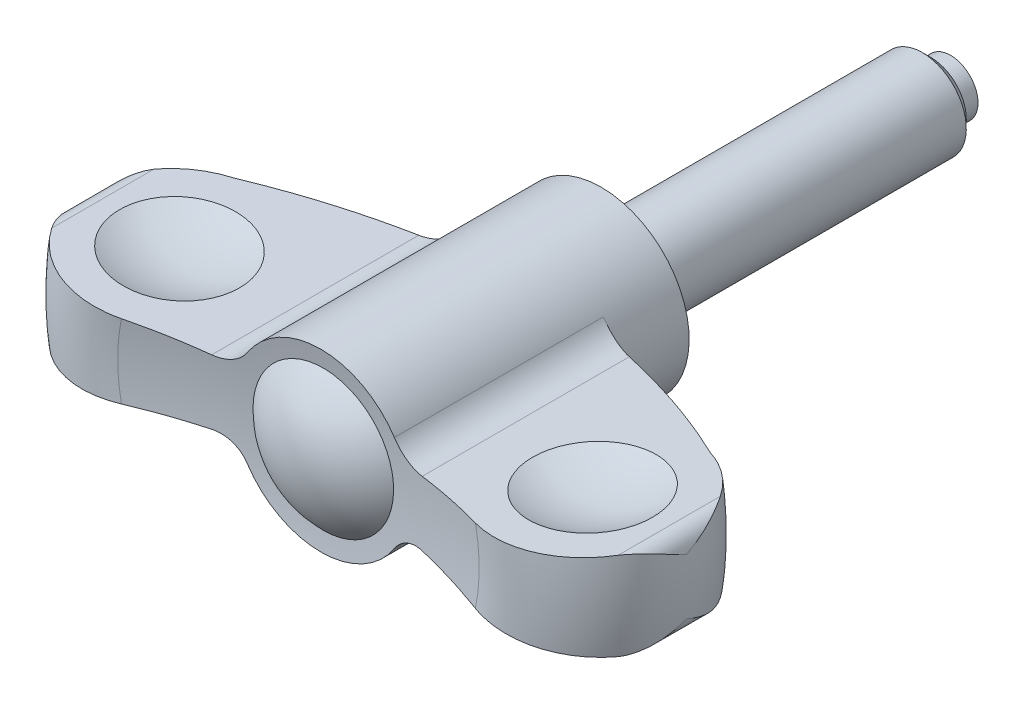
ISO-10303-21;
HEADER;
FILE_DESCRIPTION(('STEP AP214'),'2;1');
FILE_NAME('part.step','',(''),(''),'','','');
FILE_SCHEMA(('AUTOMOTIVE_DESIGN { 1 0 10303 214 1 1 1 1 }'));
ENDSEC;
DATA;
#1=APPLICATION_CONTEXT('core data for automotive mechanical design processes');
#2=APPLICATION_PROTOCOL_DEFINITION('international standard','automotive_design',2000,#1);
#3=PRODUCT_CONTEXT('',#1,'mechanical');
#4=PRODUCT('Part','Part','',(#3));
#5=PRODUCT_RELATED_PRODUCT_CATEGORY('part','',(#4));
#6=PRODUCT_DEFINITION_FORMATION('','',#4);
#7=PRODUCT_DEFINITION_CONTEXT('part definition',#1,'design');
#8=PRODUCT_DEFINITION('design','',#6,#7);
#9=PRODUCT_DEFINITION_SHAPE('','',#8);
#10=(LENGTH_UNIT() NAMED_UNIT(*) SI_UNIT(.MILLI.,.METRE.));
#11=(NAMED_UNIT(*) PLANE_ANGLE_UNIT() SI_UNIT($,.RADIAN.));
#12=(NAMED_UNIT(*) SI_UNIT($,.STERADIAN.) SOLID_ANGLE_UNIT());
#13=UNCERTAINTY_MEASURE_WITH_UNIT(LENGTH_MEASURE(1.E-05),#10,'distance_accuracy_value','');
#14=(GEOMETRIC_REPRESENTATION_CONTEXT(3) GLOBAL_UNCERTAINTY_ASSIGNED_CONTEXT((#13)) GLOBAL_UNIT_ASSIGNED_CONTEXT((#10,
#11,#12)) REPRESENTATION_CONTEXT('',''));
#15=CARTESIAN_POINT('',(0.,0.,0.));
#16=DIRECTION('',(0.,0.,1.));
#17=DIRECTION('',(1.,0.,0.));
#18=AXIS2_PLACEMENT_3D('',#15,#16,#17);
#19=CARTESIAN_POINT('',(0.,0.,69.5304878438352));
#20=DIRECTION('',(0.,0.,-1.));
#21=DIRECTION('',(0.,1.,0.));
#22=AXIS2_PLACEMENT_3D('',#19,#20,#21);
#23=DEGENERATE_TOROIDAL_SURFACE('',#22,7.49460900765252,64.9070512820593,.F.);
#24=CARTESIAN_POINT('',(9.5830790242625,2.93702964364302,7.03203264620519));
#25=CARTESIAN_POINT('',(9.49355041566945,2.93115210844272,7.00755849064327));
#26=CARTESIAN_POINT('',(9.40369287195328,2.92903508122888,6.98351825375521));
#27=CARTESIAN_POINT('',(9.22383334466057,2.93238697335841,6.93647279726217));
#28=CARTESIAN_POINT('',(9.13383133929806,2.93785717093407,6.91346775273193));
#29=CARTESIAN_POINT('',(8.86443408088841,2.96574613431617,6.84627082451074));
#30=CARTESIAN_POINT('',(8.68563801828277,2.99964263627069,6.80389452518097));
#31=CARTESIAN_POINT('',(8.33468130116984,3.09795206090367,6.72559304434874));
#32=CARTESIAN_POINT('',(8.16253484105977,3.16242674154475,6.68968112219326));
#33=CARTESIAN_POINT('',(7.91382689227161,3.28094110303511,6.64198952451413));
#34=CARTESIAN_POINT('',(7.83251517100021,3.32407563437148,6.62712257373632));
#35=CARTESIAN_POINT('',(7.67364428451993,3.4173705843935,6.5996195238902));
#36=CARTESIAN_POINT('',(7.59608369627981,3.46752831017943,6.58698257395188));
#37=CARTESIAN_POINT('',(7.44000595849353,3.57835722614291,6.56330260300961));
#38=CARTESIAN_POINT('',(7.3618120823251,3.63952209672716,6.55243652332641));
#39=CARTESIAN_POINT('',(7.21124113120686,3.76905307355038,6.53364968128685));
#40=CARTESIAN_POINT('',(7.13886437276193,3.83741957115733,6.52572907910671));
#41=CARTESIAN_POINT('',(7.00026291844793,3.9811799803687,6.5129447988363));
#42=CARTESIAN_POINT('',(6.93407706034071,4.05661299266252,6.50809944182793));
#43=CARTESIAN_POINT('',(6.80899054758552,4.21345237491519,6.50161981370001));
#44=CARTESIAN_POINT('',(6.75009171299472,4.29486022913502,6.49998634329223));
#45=CARTESIAN_POINT('',(6.69517692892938,4.3788818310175,6.50000000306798));
#46=B_SPLINE_CURVE_WITH_KNOTS('',3,(#24,#25,#26,#27,#28,#29,#30,#31,#32,#33,#34,#35,#36,#37,#38,
#39,#40,#41,#42,#43,#44,#45),.UNSPECIFIED.,.F.,.F.,(4,2,2,2,2,2,2,2,2,2,4),(0.,
0.278847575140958,0.557742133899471,1.11550180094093,1.67439278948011,1.95379713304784,
2.23309463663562,2.53222799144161,2.83137761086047,3.1322931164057,3.43328362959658),.UNSPECIFIED.);
#47=CARTESIAN_POINT('',(9.5828790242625,2.9370165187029,7.03197797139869));
#48=VERTEX_POINT('',#47);
#49=CARTESIAN_POINT('',(6.6953077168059,4.3786818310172,6.5));
#50=VERTEX_POINT('',#49);
#51=EDGE_CURVE('E156',#48,#50,#46,.T.);
#52=ORIENTED_EDGE('',*,*,#51,.F.);
#53=CARTESIAN_POINT('',(21.7147583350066,3.73278589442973,11.728840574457));
#54=CARTESIAN_POINT('',(20.7455729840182,3.66921387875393,11.2353807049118));
#55=CARTESIAN_POINT('',(19.7639491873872,3.60482598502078,10.7664976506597));
#56=CARTESIAN_POINT('',(17.7808383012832,3.47474729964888,9.88027246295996));
#57=CARTESIAN_POINT('',(16.7794089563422,3.40906029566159,9.46280054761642));
#58=CARTESIAN_POINT('',(14.7566498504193,3.27638095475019,8.67921714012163));
#59=CARTESIAN_POINT('',(13.7353195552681,3.2093885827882,8.3131070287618));
#60=CARTESIAN_POINT('',(12.1890970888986,3.10796682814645,7.80307389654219));
#61=CARTESIAN_POINT('',(11.6706211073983,3.07395830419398,7.63939380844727));
#62=CARTESIAN_POINT('',(10.6296198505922,3.00567564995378,7.32550375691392));
#63=CARTESIAN_POINT('',(10.1070945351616,2.97140151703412,7.17529392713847));
#64=CARTESIAN_POINT('',(9.58267902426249,2.93700340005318,7.03192329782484));
#65=B_SPLINE_CURVE_WITH_KNOTS('',3,(#53,#54,#55,#56,#57,#58,#59,#60,#61,#62,#63,#64),
.UNSPECIFIED.,.F.,.F.,(4,2,2,2,2,4),(0.,3.26791037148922,6.52739436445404,9.78696596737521,
11.4210933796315,13.0552370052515),.UNSPECIFIED.);
#66=CARTESIAN_POINT('',(21.7143655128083,3.73276012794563,11.728640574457));
#67=VERTEX_POINT('',#66);
#68=EDGE_CURVE('E201',#67,#48,#65,.T.);
#69=ORIENTED_EDGE('',*,*,#68,.F.);
#70=CARTESIAN_POINT('',(0.,0.,11.728640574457));
#71=DIRECTION('',(0.,0.,-1.));
#72=DIRECTION('',(0.,1.,0.));
#73=AXIS2_PLACEMENT_3D('',#70,#71,#72);
#74=CIRCLE('',#73,22.032865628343);
#75=CARTESIAN_POINT('',(21.7143655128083,-3.73276012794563,11.728640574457));
#76=VERTEX_POINT('',#75);
#77=EDGE_CURVE('E469',#67,#76,#74,.T.);
#78=ORIENTED_EDGE('',*,*,#77,.T.);
#79=CARTESIAN_POINT('',(9.5826790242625,-2.93700340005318,7.03192329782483));
#80=CARTESIAN_POINT('',(9.9949048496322,-2.9640426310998,7.14461627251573));
#81=CARTESIAN_POINT('',(10.4059768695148,-2.99100618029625,7.26154651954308));
#82=CARTESIAN_POINT('',(11.2256260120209,-3.044769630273,7.50375221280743));
#83=CARTESIAN_POINT('',(11.6342033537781,-3.07156954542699,7.62902691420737));
#84=CARTESIAN_POINT('',(12.8561119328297,-3.15171849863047,8.01723343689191));
#85=CARTESIAN_POINT('',(13.6655290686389,-3.20481079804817,8.29252285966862));
#86=CARTESIAN_POINT('',(16.069800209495,-3.36251475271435,9.16445877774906));
#87=CARTESIAN_POINT('',(17.6477654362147,-3.4660186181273,9.8091195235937));
#88=CARTESIAN_POINT('',(19.6208518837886,-3.59543976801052,10.7081143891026));
#89=CARTESIAN_POINT('',(20.0424264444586,-3.62309221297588,10.9057530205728));
#90=CARTESIAN_POINT('',(20.8816689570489,-3.67814085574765,11.310357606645));
#91=CARTESIAN_POINT('',(21.2993320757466,-3.7055367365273,11.5173336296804));
#92=CARTESIAN_POINT('',(21.7147583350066,-3.73278589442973,11.728840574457));
#93=B_SPLINE_CURVE_WITH_KNOTS('',3,(#79,#80,#81,#82,#83,#84,#85,#86,#87,#88,#89,#90,#91,#92),
.UNSPECIFIED.,.F.,.F.,(4,2,2,2,2,2,4),(0.,1.28459760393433,2.56908069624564,5.13832917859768,
10.2547803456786,11.6539949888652,13.0547562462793),.UNSPECIFIED.);
#94=CARTESIAN_POINT('',(9.5828790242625,-2.9370165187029,7.03197797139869));
#95=VERTEX_POINT('',#94);
#96=EDGE_CURVE('E262',#95,#76,#93,.T.);
#97=ORIENTED_EDGE('',*,*,#96,.F.);
#98=CARTESIAN_POINT('',(6.6951769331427,-4.37888182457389,6.50000000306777));
#99=CARTESIAN_POINT('',(6.74261015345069,-4.30632098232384,6.49999187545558));
#100=CARTESIAN_POINT('',(6.79300686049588,-4.2357050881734,6.50120778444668));
#101=CARTESIAN_POINT('',(6.89930475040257,-4.0988526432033,6.50604301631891));
#102=CARTESIAN_POINT('',(6.95520494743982,-4.03261531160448,6.50966190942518));
#103=CARTESIAN_POINT('',(7.07195291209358,-3.9051487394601,6.51924602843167));
#104=CARTESIAN_POINT('',(7.13278746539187,-3.84390694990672,6.52520514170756));
#105=CARTESIAN_POINT('',(7.25903794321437,-3.72666244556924,6.53937999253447));
#106=CARTESIAN_POINT('',(7.32445392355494,-3.67065979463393,6.54759575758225));
#107=CARTESIAN_POINT('',(7.52682049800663,-3.51109690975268,6.57547100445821));
#108=CARTESIAN_POINT('',(7.67002421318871,-3.41583549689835,6.59836973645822));
#109=CARTESIAN_POINT('',(7.96872509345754,-3.24986585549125,6.65168714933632));
#110=CARTESIAN_POINT('',(8.12423083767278,-3.17917495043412,6.68211111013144));
#111=CARTESIAN_POINT('',(8.447410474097,-3.06212812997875,6.75007257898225));
#112=CARTESIAN_POINT('',(8.61529569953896,-3.01645328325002,6.78777458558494));
#113=CARTESIAN_POINT('',(8.95489583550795,-2.95295409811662,6.8683254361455));
#114=CARTESIAN_POINT('',(9.12660576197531,-2.93509544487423,6.9111678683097));
#115=CARTESIAN_POINT('',(9.34558614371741,-2.92991895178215,6.96829133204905));
#116=CARTESIAN_POINT('',(9.39321883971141,-2.92986109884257,6.98086778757));
#117=CARTESIAN_POINT('',(9.48828894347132,-2.93186482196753,7.00626622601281));
#118=CARTESIAN_POINT('',(9.53572654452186,-2.93392285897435,7.01908776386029));
#119=CARTESIAN_POINT('',(9.5830790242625,-2.93702964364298,7.03203264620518));
#120=B_SPLINE_CURVE_WITH_KNOTS('',3,(#98,#99,#100,#101,#102,#103,#104,#105,#106,#107,#108,#109,
#110,#111,#112,#113,#114,#115,#116,#117,#118,#119),.UNSPECIFIED.,.F.,.F.,(4,2,2,2,2,2,2,2,2,2,
4),(0.,0.259976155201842,0.519905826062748,0.779161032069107,1.03841939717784,1.55634664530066,
2.07463832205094,2.60641616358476,3.13753746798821,3.28530352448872,3.43282282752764),.UNSPECIFIED.);
#121=CARTESIAN_POINT('',(6.6953077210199,-4.3786818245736,6.5));
#122=VERTEX_POINT('',#121);
#123=EDGE_CURVE('E254',#122,#95,#120,.T.);
#124=ORIENTED_EDGE('',*,*,#123,.F.);
#125=CARTESIAN_POINT('',(0.,0.,6.5));
#126=DIRECTION('',(0.,0.,-1.));
#127=DIRECTION('',(0.,1.,0.));
#128=AXIS2_PLACEMENT_3D('',#125,#126,#127);
#129=CIRCLE('',#128,8.);
#130=EDGE_CURVE('E462',#50,#122,#129,.T.);
#131=ORIENTED_EDGE('',*,*,#130,.F.);
#132=EDGE_LOOP('',(#52,#69,#78,#97,#124,#131));
#133=FACE_BOUND('',#132,.T.);
#134=ADVANCED_FACE('F14',(#133),#23,.F.);
#135=CARTESIAN_POINT('',(0.,0.,19.5999999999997));
#136=DIRECTION('',(0.,0.,-1.));
#137=DIRECTION('',(0.,1.,0.));
#138=AXIS2_PLACEMENT_3D('',#135,#136,#137);
#139=TOROIDAL_SURFACE('',#138,19.0999999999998,8.39999999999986);
#140=CARTESIAN_POINT('',(15.8176496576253,3.34597537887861,11.728440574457));
#141=CARTESIAN_POINT('',(15.592439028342,3.33120308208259,11.8116339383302));
#142=CARTESIAN_POINT('',(15.3707437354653,3.31666136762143,11.9043704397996));
#143=CARTESIAN_POINT('',(14.9359126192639,3.2881393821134,12.1081679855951));
#144=CARTESIAN_POINT('',(14.722776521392,3.27415909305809,12.219228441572));
#145=CARTESIAN_POINT('',(14.3066280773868,3.24686256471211,12.4588887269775));
#146=CARTESIAN_POINT('',(14.1036133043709,3.23354616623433,12.587484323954));
#147=CARTESIAN_POINT('',(13.709098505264,3.20766865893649,12.8613308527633));
#148=CARTESIAN_POINT('',(13.5175983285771,3.19510754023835,13.0065815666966));
#149=CARTESIAN_POINT('',(13.147420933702,3.17082640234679,13.3127951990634));
#150=CARTESIAN_POINT('',(12.9687485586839,3.15910670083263,13.4737639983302));
#151=CARTESIAN_POINT('',(12.6255559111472,3.13659558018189,13.8103172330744));
#152=CARTESIAN_POINT('',(12.4610405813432,3.12580448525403,13.985906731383));
#153=CARTESIAN_POINT('',(12.1475342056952,3.10524058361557,14.3503624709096));
#154=CARTESIAN_POINT('',(11.9985364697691,3.09546733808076,14.5392229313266));
#155=CARTESIAN_POINT('',(11.7171356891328,3.07700934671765,14.9289756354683));
#156=CARTESIAN_POINT('',(11.5847323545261,3.0683245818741,15.1298676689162));
#157=CARTESIAN_POINT('',(11.3383545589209,3.05216386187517,15.5409759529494));
#158=CARTESIAN_POINT('',(11.2242691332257,3.04468062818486,15.751125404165));
#159=CARTESIAN_POINT('',(11.014497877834,3.03092105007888,16.1803595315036));
#160=CARTESIAN_POINT('',(10.9188051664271,3.02464425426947,16.3994408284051));
#161=CARTESIAN_POINT('',(10.7465617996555,3.01334625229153,16.8450927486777));
#162=CARTESIAN_POINT('',(10.6700153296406,3.00832532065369,17.0716649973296));
#163=CARTESIAN_POINT('',(10.5367692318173,2.99958527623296,17.53059677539));
#164=CARTESIAN_POINT('',(10.4800692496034,2.99586614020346,17.7629562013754));
#165=CARTESIAN_POINT('',(10.3879653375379,2.98982474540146,18.22703267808));
#166=CARTESIAN_POINT('',(10.3521573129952,2.98747598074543,18.4586692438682));
#167=CARTESIAN_POINT('',(10.3004173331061,2.98408218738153,18.9241606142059));
#168=CARTESIAN_POINT('',(10.2844851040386,2.9830371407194,19.1580153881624));
#169=CARTESIAN_POINT('',(10.2726425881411,2.98226035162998,19.626199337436));
#170=CARTESIAN_POINT('',(10.2767294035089,2.98252841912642,19.8605284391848));
#171=CARTESIAN_POINT('',(10.3048809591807,2.98437497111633,20.3279772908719));
#172=CARTESIAN_POINT('',(10.3289455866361,2.98595344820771,20.5610970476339));
#173=CARTESIAN_POINT('',(10.3963472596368,2.99037454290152,21.0211094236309));
#174=CARTESIAN_POINT('',(10.4394036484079,2.9931987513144,21.2480434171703));
#175=CARTESIAN_POINT('',(10.5443594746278,3.00008314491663,21.697577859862));
#176=CARTESIAN_POINT('',(10.6062657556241,3.00414377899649,21.9201767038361));
#177=CARTESIAN_POINT('',(10.7483844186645,3.01346580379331,22.359389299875));
#178=CARTESIAN_POINT('',(10.8285943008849,3.01872703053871,22.5760038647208));
#179=CARTESIAN_POINT('',(11.0066740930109,3.03040786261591,23.0018204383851));
#180=CARTESIAN_POINT('',(11.104544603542,3.03682750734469,23.2110221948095));
#181=CARTESIAN_POINT('',(11.3181804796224,3.05084057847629,23.6225509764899));
#182=CARTESIAN_POINT('',(11.4341060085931,3.05844451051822,23.8247944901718));
#183=CARTESIAN_POINT('',(11.6822785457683,3.07472295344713,24.2189646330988));
#184=CARTESIAN_POINT('',(11.8145259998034,3.08339749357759,24.4108909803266));
#185=CARTESIAN_POINT('',(12.0943438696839,3.10175165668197,24.7831438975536));
#186=CARTESIAN_POINT('',(12.2419127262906,3.11143117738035,24.963471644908));
#187=CARTESIAN_POINT('',(12.5513728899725,3.13172967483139,25.311433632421));
#188=CARTESIAN_POINT('',(12.7132689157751,3.14234896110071,25.4790636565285));
#189=CARTESIAN_POINT('',(13.0536697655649,3.16467695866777,25.8037821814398));
#190=CARTESIAN_POINT('',(13.2324473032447,3.17640355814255,25.9605836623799));
#191=CARTESIAN_POINT('',(13.6024189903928,3.20067120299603,26.2587128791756));
#192=CARTESIAN_POINT('',(13.7936133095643,3.21321225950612,26.4000404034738));
#193=CARTESIAN_POINT('',(14.1871148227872,3.23902330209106,26.6662926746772));
#194=CARTESIAN_POINT('',(14.3894244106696,3.25229344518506,26.7912138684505));
#195=CARTESIAN_POINT('',(14.8036419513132,3.2794633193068,27.0237267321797));
#196=CARTESIAN_POINT('',(15.0155468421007,3.29336284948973,27.1313238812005));
#197=CARTESIAN_POINT('',(15.4501454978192,3.32186958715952,27.3296783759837));
#198=CARTESIAN_POINT('',(15.6729382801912,3.33648328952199,27.4202179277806));
#199=CARTESIAN_POINT('',(16.1253338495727,3.36615738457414,27.5821830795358));
#200=CARTESIAN_POINT('',(16.3549365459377,3.38121777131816,27.6536089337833));
#201=CARTESIAN_POINT('',(16.8193402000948,3.41167951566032,27.7768258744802));
#202=CARTESIAN_POINT('',(17.0541413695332,3.42708088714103,27.8286161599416));
#203=CARTESIAN_POINT('',(17.5272621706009,3.45811441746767,27.9121632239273));
#204=CARTESIAN_POINT('',(17.765581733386,3.47374657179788,27.9439203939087));
#205=CARTESIAN_POINT('',(18.2440929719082,3.50513367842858,27.9871504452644));
#206=CARTESIAN_POINT('',(18.4842849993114,3.52088865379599,27.9986194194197));
#207=CARTESIAN_POINT('',(18.9646922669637,3.55240012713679,28.0011454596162));
#208=CARTESIAN_POINT('',(19.2049074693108,3.56815662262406,27.9922097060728));
#209=CARTESIAN_POINT('',(19.6837359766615,3.5995645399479,27.953969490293));
#210=CARTESIAN_POINT('',(19.922349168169,3.61521595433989,27.924663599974));
#211=CARTESIAN_POINT('',(20.3962313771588,3.64629942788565,27.8458582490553));
#212=CARTESIAN_POINT('',(20.6315004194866,3.66173148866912,27.796358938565));
#213=CARTESIAN_POINT('',(21.0956069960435,3.69217374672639,27.677843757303));
#214=CARTESIAN_POINT('',(21.3244743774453,3.70718590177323,27.608945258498));
#215=CARTESIAN_POINT('',(21.775567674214,3.73677457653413,27.451976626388));
#216=CARTESIAN_POINT('',(21.9977935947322,3.7513510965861,27.3639065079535));
#217=CARTESIAN_POINT('',(22.4340985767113,3.7799697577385,27.1691523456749));
#218=CARTESIAN_POINT('',(22.6481736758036,3.79401163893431,27.062459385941));
#219=CARTESIAN_POINT('',(23.066497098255,3.82145083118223,26.8312368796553));
#220=CARTESIAN_POINT('',(23.2707458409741,3.83484816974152,26.7067080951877));
#221=CARTESIAN_POINT('',(23.666822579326,3.86082812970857,26.4414333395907));
#222=CARTESIAN_POINT('',(23.858713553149,3.87341488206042,26.3007817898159));
#223=CARTESIAN_POINT('',(24.2299141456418,3.89776313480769,26.0036989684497));
#224=CARTESIAN_POINT('',(24.409224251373,3.90952466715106,25.8472683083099));
#225=CARTESIAN_POINT('',(24.7536382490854,3.93211590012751,25.520047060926));
#226=CARTESIAN_POINT('',(24.9187678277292,3.94294728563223,25.3492835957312));
#227=CARTESIAN_POINT('',(25.2339249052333,3.96361946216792,24.9944249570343));
#228=CARTESIAN_POINT('',(25.3839616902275,3.97346086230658,24.8103381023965));
#229=CARTESIAN_POINT('',(25.5714137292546,3.98575645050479,24.5593365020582));
#230=CARTESIAN_POINT('',(25.6160937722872,3.98868715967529,24.4977802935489));
#231=CARTESIAN_POINT('',(25.7037200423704,3.99443485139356,24.3735391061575));
#232=CARTESIAN_POINT('',(25.7466680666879,3.99725195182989,24.3108554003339));
#233=CARTESIAN_POINT('',(25.788763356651,4.00001311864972,24.2475919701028));
#234=B_SPLINE_CURVE_WITH_KNOTS('',3,(#140,#141,#142,#143,#144,#145,#146,#147,#148,#149,#150,
#151,#152,#153,#154,#155,#156,#157,#158,#159,#160,#161,#162,#163,#164,#165,#166,#167,#168,#169,
#170,#171,#172,#173,#174,#175,#176,#177,#178,#179,#180,#181,#182,#183,#184,#185,#186,#187,#188,
#189,#190,#191,#192,#193,#194,#195,#196,#197,#198,#199,#200,#201,#202,#203,#204,#205,#206,#207,
#208,#209,#210,#211,#212,#213,#214,#215,#216,#217,#218,#219,#220,#221,#222,#223,#224,#225,#226,
#227,#228,#229,#230,#231,#232,#233),.UNSPECIFIED.,.F.,.F.,(4,2,2,2,2,2,2,2,2,2,2,2,2,2,2,2,2,2,
2,2,2,2,2,2,2,2,2,2,2,2,2,2,2,2,2,2,2,2,2,2,2,2,2,2,2,2,4),(0.,0.721398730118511,
1.44277430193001,2.16397606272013,2.88516838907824,3.60663158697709,4.32834565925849,
5.04974728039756,5.77113629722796,6.4879754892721,7.20454594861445,7.92127291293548,
8.63798707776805,9.34033480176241,10.0426728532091,10.7449092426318,11.4471416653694,
12.1393272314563,12.8317643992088,13.5241070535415,14.2164732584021,14.9153735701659,
15.6142929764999,16.313141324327,17.012220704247,17.725650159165,18.4390893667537,
19.1526828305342,19.8660501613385,20.5879860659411,21.3099123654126,22.0318681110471,
22.7538097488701,23.4758904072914,24.197717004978,24.9195942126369,25.6414660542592,
26.3590608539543,27.0766550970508,27.7945938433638,28.5125019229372,29.2264019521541,
29.9402743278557,30.6528250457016,31.3649346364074,31.5932709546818,31.8213638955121),.UNSPECIFIED.);
#235=CARTESIAN_POINT('',(16.1118579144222,3.36527345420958,27.574212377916));
#236=VERTEX_POINT('',#235);
#237=CARTESIAN_POINT('',(25.788563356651,4.,24.2478925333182));
#238=VERTEX_POINT('',#237);
#239=EDGE_CURVE('E270',#236,#238,#234,.T.);
#240=ORIENTED_EDGE('',*,*,#239,.F.);
#241=CARTESIAN_POINT('',(0.,0.,27.574212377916));
#242=DIRECTION('',(0.,0.,-1.));
#243=DIRECTION('',(0.,1.,0.));
#244=AXIS2_PLACEMENT_3D('',#241,#242,#243);
#245=CIRCLE('',#244,16.459557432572);
#246=CARTESIAN_POINT('',(16.1118579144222,-3.36527345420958,27.574212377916));
#247=VERTEX_POINT('',#246);
#248=EDGE_CURVE('E207',#236,#247,#245,.T.);
#249=ORIENTED_EDGE('',*,*,#248,.T.);
#250=CARTESIAN_POINT('',(25.788763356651,-4.00001311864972,24.2475919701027));
#251=CARTESIAN_POINT('',(25.6577100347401,-3.99141690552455,24.4445970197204));
#252=CARTESIAN_POINT('',(25.5182985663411,-3.98227245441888,24.6360103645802));
#253=CARTESIAN_POINT('',(25.2238672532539,-3.96295974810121,25.006355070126));
#254=CARTESIAN_POINT('',(25.0688484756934,-3.95279156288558,25.1852872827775));
#255=CARTESIAN_POINT('',(24.7444385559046,-3.93151246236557,25.5292433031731));
#256=CARTESIAN_POINT('',(24.575060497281,-3.92040240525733,25.6942795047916));
#257=CARTESIAN_POINT('',(24.2230386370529,-3.8973121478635,26.0094684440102));
#258=CARTESIAN_POINT('',(24.0403949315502,-3.88533195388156,26.159621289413));
#259=CARTESIAN_POINT('',(23.6630826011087,-3.86058281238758,26.4440460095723));
#260=CARTESIAN_POINT('',(23.4684097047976,-3.84781358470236,26.5783121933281));
#261=CARTESIAN_POINT('',(23.068488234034,-3.8215814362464,26.8299733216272));
#262=CARTESIAN_POINT('',(22.8632394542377,-3.80811850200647,26.9473679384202));
#263=CARTESIAN_POINT('',(22.4436655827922,-3.78059728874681,27.1644600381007));
#264=CARTESIAN_POINT('',(22.2293418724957,-3.76653910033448,27.2641602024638));
#265=CARTESIAN_POINT('',(21.7931120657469,-3.73792537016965,27.4452089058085));
#266=CARTESIAN_POINT('',(21.5712059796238,-3.72336982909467,27.5265574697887));
#267=CARTESIAN_POINT('',(21.1206337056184,-3.69381532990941,27.6705991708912));
#268=CARTESIAN_POINT('',(20.8919475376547,-3.67881506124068,27.73322953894));
#269=CARTESIAN_POINT('',(20.4300628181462,-3.64851854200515,27.8390784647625));
#270=CARTESIAN_POINT('',(20.1968627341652,-3.63322219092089,27.8822903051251));
#271=CARTESIAN_POINT('',(19.7276769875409,-3.60244677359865,27.9489987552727));
#272=CARTESIAN_POINT('',(19.491691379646,-3.5869677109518,27.972495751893));
#273=CARTESIAN_POINT('',(19.0185821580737,-3.55593494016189,27.9996449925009));
#274=CARTESIAN_POINT('',(18.7814585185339,-3.54038123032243,28.0032967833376));
#275=CARTESIAN_POINT('',(18.3062787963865,-3.50921264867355,27.9907230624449));
#276=CARTESIAN_POINT('',(18.0682259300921,-3.49359798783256,27.9743753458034));
#277=CARTESIAN_POINT('',(17.5943200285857,-3.46251296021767,27.9217427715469));
#278=CARTESIAN_POINT('',(17.3584670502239,-3.44704259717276,27.8854574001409));
#279=CARTESIAN_POINT('',(16.8906665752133,-3.41635804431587,27.7932416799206));
#280=CARTESIAN_POINT('',(16.6587183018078,-3.4011438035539,27.737315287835));
#281=CARTESIAN_POINT('',(16.2002232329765,-3.37106962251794,27.6062097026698));
#282=CARTESIAN_POINT('',(15.9736782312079,-3.35620979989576,27.5310242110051));
#283=CARTESIAN_POINT('',(15.5262824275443,-3.32686365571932,27.3614335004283));
#284=CARTESIAN_POINT('',(15.3054749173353,-3.31238017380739,27.2669135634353));
#285=CARTESIAN_POINT('',(14.8725641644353,-3.28398415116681,27.0596173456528));
#286=CARTESIAN_POINT('',(14.6604609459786,-3.27007161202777,26.9468410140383));
#287=CARTESIAN_POINT('',(14.2464132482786,-3.24291287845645,26.7037979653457));
#288=CARTESIAN_POINT('',(14.044471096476,-3.22966683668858,26.5735272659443));
#289=CARTESIAN_POINT('',(13.6523023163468,-3.20394321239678,26.2964676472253));
#290=CARTESIAN_POINT('',(13.462071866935,-3.19146537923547,26.1496841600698));
#291=CARTESIAN_POINT('',(13.0941833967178,-3.16733437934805,25.8402050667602));
#292=CARTESIAN_POINT('',(12.9165567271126,-3.155683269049,25.6774720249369));
#293=CARTESIAN_POINT('',(12.5756939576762,-3.13332497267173,25.3375195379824));
#294=CARTESIAN_POINT('',(12.4124575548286,-3.12261776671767,25.1603003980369));
#295=CARTESIAN_POINT('',(12.1016007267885,-3.10222765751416,24.7925972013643));
#296=CARTESIAN_POINT('',(11.9539804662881,-3.09254476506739,24.6021130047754));
#297=CARTESIAN_POINT('',(11.6755090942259,-3.07427892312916,24.2092140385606));
#298=CARTESIAN_POINT('',(11.5446574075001,-3.06569593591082,24.0067996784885));
#299=CARTESIAN_POINT('',(11.3017883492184,-3.04976536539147,23.5931960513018));
#300=CARTESIAN_POINT('',(11.1896228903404,-3.04240806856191,23.3820941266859));
#301=CARTESIAN_POINT('',(10.9837731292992,-3.02890571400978,22.9511259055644));
#302=CARTESIAN_POINT('',(10.8900814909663,-3.02276017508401,22.731263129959));
#303=CARTESIAN_POINT('',(10.7219179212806,-3.0117297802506,22.2842548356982));
#304=CARTESIAN_POINT('',(10.6474473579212,-3.00684501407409,22.0571087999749));
#305=CARTESIAN_POINT('',(10.5183956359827,-2.99838009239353,21.597211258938));
#306=CARTESIAN_POINT('',(10.4638141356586,-2.99479991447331,21.3644598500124));
#307=CARTESIAN_POINT('',(10.3759343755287,-2.98903559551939,20.8998212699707));
#308=CARTESIAN_POINT('',(10.3422290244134,-2.98682475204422,20.6680113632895));
#309=CARTESIAN_POINT('',(10.2946940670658,-2.98370677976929,20.2023545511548));
#310=CARTESIAN_POINT('',(10.2808641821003,-2.98279963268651,19.9685076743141));
#311=CARTESIAN_POINT('',(10.2732062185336,-2.98229732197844,19.5005025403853));
#312=CARTESIAN_POINT('',(10.2793766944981,-2.98270206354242,19.2663443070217));
#313=CARTESIAN_POINT('',(10.3116599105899,-2.98481962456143,18.7994136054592));
#314=CARTESIAN_POINT('',(10.3377725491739,-2.98653243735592,18.5666411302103));
#315=CARTESIAN_POINT('',(10.4092059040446,-2.99121798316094,18.1073705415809));
#316=CARTESIAN_POINT('',(10.4542565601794,-2.9941730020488,17.880830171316));
#317=CARTESIAN_POINT('',(10.5631529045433,-3.0013158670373,17.4322470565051));
#318=CARTESIAN_POINT('',(10.6270053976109,-3.0055041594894,17.2102059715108));
#319=CARTESIAN_POINT('',(10.7729455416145,-3.01507684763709,16.7722877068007));
#320=CARTESIAN_POINT('',(10.8550288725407,-3.02046095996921,16.5564090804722));
#321=CARTESIAN_POINT('',(11.0367765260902,-3.03238237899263,16.1322106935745));
#322=CARTESIAN_POINT('',(11.1364415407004,-3.03891973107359,15.923891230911));
#323=CARTESIAN_POINT('',(11.3536372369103,-3.05316630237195,15.5141908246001));
#324=CARTESIAN_POINT('',(11.4713341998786,-3.06088642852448,15.312898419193));
#325=CARTESIAN_POINT('',(11.7229581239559,-3.07739125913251,14.9207760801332));
#326=CARTESIAN_POINT('',(11.8568851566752,-3.08617596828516,14.7299461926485));
#327=CARTESIAN_POINT('',(12.1400516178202,-3.10474977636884,14.3599029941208));
#328=CARTESIAN_POINT('',(12.2892990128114,-3.11453939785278,14.1806958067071));
#329=CARTESIAN_POINT('',(12.6019741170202,-3.13504877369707,13.8351741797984));
#330=CARTESIAN_POINT('',(12.7654017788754,-3.14576852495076,13.668859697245));
#331=CARTESIAN_POINT('',(13.1089754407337,-3.16830463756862,13.3467486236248));
#332=CARTESIAN_POINT('',(13.2894066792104,-3.18013970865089,13.1912574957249));
#333=CARTESIAN_POINT('',(13.662521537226,-3.20461352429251,12.8959594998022));
#334=CARTESIAN_POINT('',(13.8552007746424,-3.2172519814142,12.7561470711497));
#335=CARTESIAN_POINT('',(14.2512125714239,-3.24322768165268,12.4932872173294));
#336=CARTESIAN_POINT('',(14.4545292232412,-3.25656388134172,12.3702156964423));
#337=CARTESIAN_POINT('',(14.8705820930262,-3.28385414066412,12.1414872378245));
#338=CARTESIAN_POINT('',(15.0833128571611,-3.29780784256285,12.0358203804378));
#339=CARTESIAN_POINT('',(15.3851506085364,-3.31760636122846,11.9012480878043));
#340=CARTESIAN_POINT('',(15.4709196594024,-3.32323223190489,11.8646802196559));
#341=CARTESIAN_POINT('',(15.643498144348,-3.33455221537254,11.7944158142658));
#342=CARTESIAN_POINT('',(15.7303061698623,-3.34024623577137,11.7607158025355));
#343=CARTESIAN_POINT('',(15.8176496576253,-3.34597537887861,11.728440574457));
#344=B_SPLINE_CURVE_WITH_KNOTS('',3,(#250,#251,#252,#253,#254,#255,#256,#257,#258,#259,#260,
#261,#262,#263,#264,#265,#266,#267,#268,#269,#270,#271,#272,#273,#274,#275,#276,#277,#278,#279,
#280,#281,#282,#283,#284,#285,#286,#287,#288,#289,#290,#291,#292,#293,#294,#295,#296,#297,#298,
#299,#300,#301,#302,#303,#304,#305,#306,#307,#308,#309,#310,#311,#312,#313,#314,#315,#316,#317,
#318,#319,#320,#321,#322,#323,#324,#325,#326,#327,#328,#329,#330,#331,#332,#333,#334,#335,#336,
#337,#338,#339,#340,#341,#342,#343),.UNSPECIFIED.,.F.,.F.,(4,2,2,2,2,2,2,2,2,2,2,2,2,2,2,2,2,2,
2,2,2,2,2,2,2,2,2,2,2,2,2,2,2,2,2,2,2,2,2,2,2,2,2,2,2,2,4),(0.,0.710088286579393,
1.42012805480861,2.12952767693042,2.83892216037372,3.54857000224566,4.25823162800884,
4.96778561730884,5.67733864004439,6.38924502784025,7.10139749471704,7.81353598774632,
8.52569074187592,9.24221886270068,9.958765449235,10.6751677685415,11.3918046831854,
12.112823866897,12.8338450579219,13.5550306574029,14.2759797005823,14.9986633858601,
15.7213318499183,16.4440079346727,17.1666592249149,17.8832788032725,18.5996132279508,
19.3159986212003,20.0323717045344,20.7342950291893,21.4362085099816,22.1380712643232,
22.83993044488,23.532103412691,24.2245272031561,24.9167870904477,25.609074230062,
26.3081792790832,27.0072874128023,27.7067609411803,28.4062321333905,29.1208388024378,
29.8351912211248,30.5485043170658,31.2614094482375,31.5415963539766,31.8214388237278),.UNSPECIFIED.);
#345=CARTESIAN_POINT('',(25.788563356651,-4.,24.2478925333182));
#346=VERTEX_POINT('',#345);
#347=EDGE_CURVE('E292',#346,#247,#344,.T.);
#348=ORIENTED_EDGE('',*,*,#347,.F.);
#349=CARTESIAN_POINT('',(27.3816792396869,-2.5482625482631,19.5999999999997));
#350=CARTESIAN_POINT('',(27.3814470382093,-2.55075771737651,19.6055723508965));
#351=CARTESIAN_POINT('',(27.3812089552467,-2.55325243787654,19.6111448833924));
#352=CARTESIAN_POINT('',(27.3600015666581,-2.77007441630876,20.0955732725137));
#353=CARTESIAN_POINT('',(27.2956220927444,-2.98092520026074,20.5757161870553));
#354=CARTESIAN_POINT('',(27.1353355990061,-3.27088713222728,21.291202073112));
#355=CARTESIAN_POINT('',(27.0712358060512,-3.36319776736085,21.5290353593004));
#356=CARTESIAN_POINT('',(26.9218052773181,-3.5352201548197,22.0027028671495));
#357=CARTESIAN_POINT('',(26.8364849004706,-3.61493802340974,22.2385380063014));
#358=CARTESIAN_POINT('',(26.6785811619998,-3.73185454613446,22.6245014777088));
#359=CARTESIAN_POINT('',(26.6120713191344,-3.77414678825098,22.7756024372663));
#360=CARTESIAN_POINT('',(26.4704174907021,-3.84966003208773,23.0759023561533));
#361=CARTESIAN_POINT('',(26.3952804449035,-3.88288825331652,23.2251027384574));
#362=CARTESIAN_POINT('',(26.2362098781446,-3.93842231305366,23.521823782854));
#363=CARTESIAN_POINT('',(26.1522372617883,-3.96067689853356,23.6693334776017));
#364=CARTESIAN_POINT('',(26.0202447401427,-3.98376869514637,23.8882514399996));
#365=CARTESIAN_POINT('',(25.9751822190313,-3.98975195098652,23.9609213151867));
#366=CARTESIAN_POINT('',(25.8831625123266,-3.99786728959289,24.105310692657));
#367=CARTESIAN_POINT('',(25.8362045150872,-3.99999770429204,24.177029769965));
#368=CARTESIAN_POINT('',(25.7883633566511,-3.99999998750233,24.2481900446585));
#369=B_SPLINE_CURVE_WITH_KNOTS('',3,(#349,#350,#351,#352,#353,#354,#355,#356,#357,#358,#359,
#360,#361,#362,#363,#364,#365,#366,#367,#368),.UNSPECIFIED.,.F.,.F.,(4,2,2,2,2,2,2,2,2,4),(0.,
0.0183303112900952,1.59343088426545,2.38182586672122,3.16983674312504,3.6807108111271,
4.19117677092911,4.70400482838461,4.96105475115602,5.21821593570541),.UNSPECIFIED.);
#370=CARTESIAN_POINT('',(27.381679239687,-2.5482625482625,19.5999999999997));
#371=VERTEX_POINT('',#370);
#372=EDGE_CURVE('E495',#371,#346,#369,.T.);
#373=ORIENTED_EDGE('',*,*,#372,.F.);
#374=CARTESIAN_POINT('',(25.788363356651,-3.9999999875,14.9518099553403));
#375=CARTESIAN_POINT('',(25.8262339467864,-4.00000140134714,15.0081410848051));
#376=CARTESIAN_POINT('',(25.8635545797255,-3.9986652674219,15.0648259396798));
#377=CARTESIAN_POINT('',(25.9370280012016,-3.99352324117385,15.1788190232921));
#378=CARTESIAN_POINT('',(25.9731810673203,-3.98971794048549,15.2361270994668));
#379=CARTESIAN_POINT('',(26.0797021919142,-3.97492063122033,15.4087198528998));
#380=CARTESIAN_POINT('',(26.1482515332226,-3.96054592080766,15.5248504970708));
#381=CARTESIAN_POINT('',(26.2798587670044,-3.92422749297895,15.758344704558));
#382=CARTESIAN_POINT('',(26.3429380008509,-3.90231501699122,15.8757012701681));
#383=CARTESIAN_POINT('',(26.4637684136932,-3.85202649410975,16.1118228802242));
#384=CARTESIAN_POINT('',(26.5215166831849,-3.82364694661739,16.2305886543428));
#385=CARTESIAN_POINT('',(26.6683904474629,-3.74054142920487,16.5491404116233));
#386=CARTESIAN_POINT('',(26.7526320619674,-3.68089872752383,16.7499241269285));
#387=CARTESIAN_POINT('',(26.9055854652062,-3.54995730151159,17.1535346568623));
#388=CARTESIAN_POINT('',(26.9742898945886,-3.47865308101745,17.3563623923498));
#389=CARTESIAN_POINT('',(27.1571312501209,-3.25138843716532,17.9676801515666));
#390=CARTESIAN_POINT('',(27.2478257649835,-3.08218354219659,18.3786338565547));
#391=CARTESIAN_POINT('',(27.325688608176,-2.84816243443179,18.9221003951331));
#392=CARTESIAN_POINT('',(27.3413470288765,-2.7904146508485,19.0543464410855));
#393=CARTESIAN_POINT('',(27.3660874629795,-2.67379406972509,19.3188310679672));
#394=CARTESIAN_POINT('',(27.3751771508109,-2.61492266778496,19.4510694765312));
#395=CARTESIAN_POINT('',(27.381208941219,-2.55325250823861,19.5888549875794));
#396=CARTESIAN_POINT('',(27.3814470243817,-2.55075778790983,19.5944275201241));
#397=CARTESIAN_POINT('',(27.3816792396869,-2.5482625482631,19.5999999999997));
#398=B_SPLINE_CURVE_WITH_KNOTS('',3,(#374,#375,#376,#377,#378,#379,#380,#381,#382,#383,#384,
#385,#386,#387,#388,#389,#390,#391,#392,#393,#394,#395,#396,#397),.UNSPECIFIED.,.F.,.F.,(4,2,2,
2,2,2,2,2,2,2,2,4),(0.,0.203594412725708,0.407140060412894,0.813591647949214,1.21837853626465,
1.62338505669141,2.2995999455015,2.97613446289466,4.33045572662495,4.76586348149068,
5.20076171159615,5.21909202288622),.UNSPECIFIED.);
#399=CARTESIAN_POINT('',(25.788563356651,-4.,14.9521074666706));
#400=VERTEX_POINT('',#399);
#401=EDGE_CURVE('E493',#400,#371,#398,.T.);
#402=ORIENTED_EDGE('',*,*,#401,.F.);
#403=CARTESIAN_POINT('',(21.7138268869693,-3.73272479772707,11.728440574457));
#404=CARTESIAN_POINT('',(21.9384901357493,-3.74746119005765,11.8118230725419));
#405=CARTESIAN_POINT('',(22.1595961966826,-3.76196425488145,11.9048358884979));
#406=CARTESIAN_POINT('',(22.5931300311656,-3.79040114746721,12.1093676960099));
#407=CARTESIAN_POINT('',(22.8055573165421,-3.8043349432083,12.2208877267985));
#408=CARTESIAN_POINT('',(23.2148057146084,-3.83117887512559,12.4585695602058));
#409=CARTESIAN_POINT('',(23.4118878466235,-3.84410613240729,12.5842803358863));
#410=CARTESIAN_POINT('',(23.7949167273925,-3.86923024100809,12.8516751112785));
#411=CARTESIAN_POINT('',(23.9808652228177,-3.88142720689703,12.9933565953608));
#412=CARTESIAN_POINT('',(24.3154435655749,-3.90337328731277,13.2710653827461));
#413=CARTESIAN_POINT('',(24.4656760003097,-3.91322752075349,13.4051600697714));
#414=CARTESIAN_POINT('',(24.7561477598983,-3.93228050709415,13.6838126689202));
#415=CARTESIAN_POINT('',(24.8963873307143,-3.94147927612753,13.8283703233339));
#416=CARTESIAN_POINT('',(25.1692026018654,-3.95937411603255,14.1306123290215));
#417=CARTESIAN_POINT('',(25.3015315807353,-3.96805400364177,14.2885203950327));
#418=CARTESIAN_POINT('',(25.5542714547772,-3.98463203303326,14.6136774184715));
#419=CARTESIAN_POINT('',(25.6746806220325,-3.99253006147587,14.7809277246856));
#420=CARTESIAN_POINT('',(25.788763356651,-4.00001311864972,14.9524080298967));
#421=B_SPLINE_CURVE_WITH_KNOTS('',3,(#403,#404,#405,#406,#407,#408,#409,#410,#411,#412,#413,
#414,#415,#416,#417,#418,#419,#420),.UNSPECIFIED.,.F.,.F.,(4,2,2,2,2,2,2,2,4),(0.,
0.720059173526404,1.4401587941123,2.14171385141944,2.84315855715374,3.44749597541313,
4.05181851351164,4.66988016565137,5.28803128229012),.UNSPECIFIED.);
#422=EDGE_CURVE('E271',#76,#400,#421,.T.);
#423=ORIENTED_EDGE('',*,*,#422,.F.);
#424=ORIENTED_EDGE('',*,*,#77,.F.);
#425=CARTESIAN_POINT('',(25.788763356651,4.00001311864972,14.9524080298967));
#426=CARTESIAN_POINT('',(25.65606919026,3.99130927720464,14.7529331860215));
#427=CARTESIAN_POINT('',(25.5148018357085,3.98204309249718,14.5591895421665));
#428=CARTESIAN_POINT('',(25.2162671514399,3.96246123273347,14.1845014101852));
#429=CARTESIAN_POINT('',(25.0589996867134,3.95214554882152,14.0035570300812));
#430=CARTESIAN_POINT('',(24.7338454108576,3.93081762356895,13.660275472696));
#431=CARTESIAN_POINT('',(24.5663353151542,3.91983009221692,13.4975796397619));
#432=CARTESIAN_POINT('',(24.2184113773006,3.89700863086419,13.1867298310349));
#433=CARTESIAN_POINT('',(24.0379993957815,3.88517482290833,13.0385737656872));
#434=CARTESIAN_POINT('',(23.6908154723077,3.86240190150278,12.7768587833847));
#435=CARTESIAN_POINT('',(23.5255145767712,3.85155927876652,12.6613332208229));
#436=CARTESIAN_POINT('',(23.1870691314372,3.82935954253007,12.4424606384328));
#437=CARTESIAN_POINT('',(23.0139247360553,3.81800243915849,12.3391133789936));
#438=CARTESIAN_POINT('',(22.6566675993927,3.79456878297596,12.142911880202));
#439=CARTESIAN_POINT('',(22.4723948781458,3.78248173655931,12.0503501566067));
#440=CARTESIAN_POINT('',(22.0975668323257,3.75789554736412,11.8789681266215));
#441=CARTESIAN_POINT('',(21.9070107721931,3.74539635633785,11.8001494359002));
#442=CARTESIAN_POINT('',(21.7138268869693,3.73272479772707,11.728440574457));
#443=B_SPLINE_CURVE_WITH_KNOTS('',3,(#425,#426,#427,#428,#429,#430,#431,#432,#433,#434,#435,
#436,#437,#438,#439,#440,#441,#442),.UNSPECIFIED.,.F.,.F.,(4,2,2,2,2,2,2,2,4),(0.,
0.718988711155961,1.43798348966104,2.13850299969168,2.83892168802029,3.44429742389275,
4.04966124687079,4.66880948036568,5.28803045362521),.UNSPECIFIED.);
#444=CARTESIAN_POINT('',(25.788563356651,4.,14.9521074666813));
#445=VERTEX_POINT('',#444);
#446=EDGE_CURVE('E490',#445,#67,#443,.T.);
#447=ORIENTED_EDGE('',*,*,#446,.F.);
#448=CARTESIAN_POINT('',(27.3816792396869,2.5482625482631,19.5999999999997));
#449=CARTESIAN_POINT('',(27.3814470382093,2.55075771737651,19.5944276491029));
#450=CARTESIAN_POINT('',(27.3812089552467,2.55325243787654,19.588855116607));
#451=CARTESIAN_POINT('',(27.3600015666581,2.7700744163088,19.1044267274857));
#452=CARTESIAN_POINT('',(27.2956220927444,2.98092520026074,18.6242838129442));
#453=CARTESIAN_POINT('',(27.1353355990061,3.27088713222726,17.9087979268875));
#454=CARTESIAN_POINT('',(27.0712358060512,3.36319776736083,17.670964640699));
#455=CARTESIAN_POINT('',(26.9218052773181,3.53522015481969,17.19729713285));
#456=CARTESIAN_POINT('',(26.8364849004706,3.61493802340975,16.9614619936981));
#457=CARTESIAN_POINT('',(26.6785811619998,3.73185454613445,16.5754985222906));
#458=CARTESIAN_POINT('',(26.6120713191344,3.77414678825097,16.4243975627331));
#459=CARTESIAN_POINT('',(26.4704174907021,3.84966003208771,16.1240976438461));
#460=CARTESIAN_POINT('',(26.3952804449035,3.88288825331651,15.9748972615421));
#461=CARTESIAN_POINT('',(26.2362098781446,3.93842231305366,15.6781762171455));
#462=CARTESIAN_POINT('',(26.1522372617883,3.96067689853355,15.5306665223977));
#463=CARTESIAN_POINT('',(26.0202447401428,3.98376869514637,15.3117485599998));
#464=CARTESIAN_POINT('',(25.9751822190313,3.98975195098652,15.2390786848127));
#465=CARTESIAN_POINT('',(25.8831625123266,3.99786728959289,15.0946893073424));
#466=CARTESIAN_POINT('',(25.8362045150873,3.99999770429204,15.0229702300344));
#467=CARTESIAN_POINT('',(25.7883633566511,3.99999998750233,14.9518099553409));
#468=B_SPLINE_CURVE_WITH_KNOTS('',3,(#448,#449,#450,#451,#452,#453,#454,#455,#456,#457,#458,
#459,#460,#461,#462,#463,#464,#465,#466,#467),.UNSPECIFIED.,.F.,.F.,(4,2,2,2,2,2,2,2,2,4),(0.,
0.0183303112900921,1.59343088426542,2.38182586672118,3.16983674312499,3.68071081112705,
4.19117677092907,4.70400482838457,4.96105475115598,5.21821593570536),.UNSPECIFIED.);
#469=CARTESIAN_POINT('',(27.381679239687,2.54826254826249,19.5999999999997));
#470=VERTEX_POINT('',#469);
#471=EDGE_CURVE('E498',#470,#445,#468,.T.);
#472=ORIENTED_EDGE('',*,*,#471,.F.);
#473=CARTESIAN_POINT('',(25.788363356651,3.9999999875,24.2481900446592));
#474=CARTESIAN_POINT('',(25.8262339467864,4.00000140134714,24.1918589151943));
#475=CARTESIAN_POINT('',(25.8635545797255,3.9986652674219,24.1351740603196));
#476=CARTESIAN_POINT('',(25.9370280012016,3.99352324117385,24.0211809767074));
#477=CARTESIAN_POINT('',(25.9731810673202,3.9897179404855,23.9638729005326));
#478=CARTESIAN_POINT('',(26.0797021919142,3.97492063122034,23.7912801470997));
#479=CARTESIAN_POINT('',(26.1482515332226,3.96054592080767,23.6751495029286));
#480=CARTESIAN_POINT('',(26.2798587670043,3.92422749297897,23.4416552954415));
#481=CARTESIAN_POINT('',(26.3429380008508,3.90231501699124,23.3242987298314));
#482=CARTESIAN_POINT('',(26.4637684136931,3.85202649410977,23.0881771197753));
#483=CARTESIAN_POINT('',(26.5215166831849,3.8236469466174,22.9694113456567));
#484=CARTESIAN_POINT('',(26.6683904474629,3.74054142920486,22.6508595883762));
#485=CARTESIAN_POINT('',(26.7526320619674,3.68089872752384,22.450075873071));
#486=CARTESIAN_POINT('',(26.9055854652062,3.5499573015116,22.0464653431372));
#487=CARTESIAN_POINT('',(26.9742898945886,3.47865308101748,21.8436376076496));
#488=CARTESIAN_POINT('',(27.1571312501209,3.25138843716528,21.2323198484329));
#489=CARTESIAN_POINT('',(27.2478257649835,3.08218354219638,20.8213661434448));
#490=CARTESIAN_POINT('',(27.325688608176,2.84816243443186,20.2778996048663));
#491=CARTESIAN_POINT('',(27.3413470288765,2.79041465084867,20.1456535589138));
#492=CARTESIAN_POINT('',(27.3660874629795,2.67379406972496,19.8811689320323));
#493=CARTESIAN_POINT('',(27.3751771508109,2.61492266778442,19.7489305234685));
#494=CARTESIAN_POINT('',(27.381208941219,2.55325250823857,19.61114501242));
#495=CARTESIAN_POINT('',(27.3814470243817,2.55075778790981,19.6055724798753));
#496=CARTESIAN_POINT('',(27.3816792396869,2.5482625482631,19.5999999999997));
#497=B_SPLINE_CURVE_WITH_KNOTS('',3,(#473,#474,#475,#476,#477,#478,#479,#480,#481,#482,#483,
#484,#485,#486,#487,#488,#489,#490,#491,#492,#493,#494,#495,#496),.UNSPECIFIED.,.F.,.F.,(4,2,2,
2,2,2,2,2,2,2,2,4),(0.,0.203594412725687,0.407140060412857,0.813591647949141,1.21837853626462,
1.62338505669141,2.29959994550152,2.9761344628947,4.33045572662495,4.7658634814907,
5.20076171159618,5.21909202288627),.UNSPECIFIED.);
#498=EDGE_CURVE('E496',#238,#470,#497,.T.);
#499=ORIENTED_EDGE('',*,*,#498,.F.);
#500=EDGE_LOOP('',(#240,#249,#348,#373,#402,#423,#424,#447,#472,#499));
#501=FACE_BOUND('',#500,.T.);
#502=ADVANCED_FACE('F452',(#501),#139,.T.);
#503=CARTESIAN_POINT('',(0.,0.,0.));
#504=DIRECTION('',(0.,0.,-1.));
#505=DIRECTION('',(0.,1.,0.));
#506=AXIS2_PLACEMENT_3D('',#503,#504,#505);
#507=PLANE('',#506);
#508=CARTESIAN_POINT('',(0.,0.,0.));
#509=DIRECTION('',(0.,0.,-1.));
#510=DIRECTION('',(0.,1.,0.));
#511=AXIS2_PLACEMENT_3D('',#508,#509,#510);
#512=CIRCLE('',#511,4.);
#513=CARTESIAN_POINT('',(0.,4.,0.));
#514=VERTEX_POINT('',#513);
#515=EDGE_CURVE('E537',#514,#514,#512,.T.);
#516=ORIENTED_EDGE('',*,*,#515,.F.);
#517=EDGE_LOOP('',(#516));
#518=FACE_BOUND('',#517,.T.);
#519=CARTESIAN_POINT('',(0.,0.,0.));
#520=DIRECTION('',(0.,0.,-1.));
#521=DIRECTION('',(0.,1.,0.));
#522=AXIS2_PLACEMENT_3D('',#519,#520,#521);
#523=CIRCLE('',#522,8.);
#524=CARTESIAN_POINT('',(0.,8.,0.));
#525=VERTEX_POINT('',#524);
#526=EDGE_CURVE('E148',#525,#525,#523,.T.);
#527=ORIENTED_EDGE('',*,*,#526,.T.);
#528=EDGE_LOOP('',(#527));
#529=FACE_BOUND('',#528,.T.);
#530=ADVANCED_FACE('F16',(#518,#529),#507,.T.);
#531=CARTESIAN_POINT('',(0.,0.,28.));
#532=DIRECTION('',(0.,0.,-1.));
#533=DIRECTION('',(0.,1.,0.));
#534=AXIS2_PLACEMENT_3D('',#531,#532,#533);
#535=CYLINDRICAL_SURFACE('',#534,8.);
#536=ORIENTED_EDGE('',*,*,#526,.F.);
#537=EDGE_LOOP('',(#536));
#538=FACE_BOUND('',#537,.T.);
#539=DIRECTION('',(0.,0.,-1.));
#540=VECTOR('',#539,1.);
#541=CARTESIAN_POINT('',(6.6953077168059,4.3786818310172,55.));
#542=LINE('',#541,#540);
#543=CARTESIAN_POINT('',(6.6953077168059,4.3786818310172,25.534739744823));
#544=VERTEX_POINT('',#543);
#545=EDGE_CURVE('E142',#544,#50,#542,.T.);
#546=ORIENTED_EDGE('',*,*,#545,.T.);
#547=ORIENTED_EDGE('',*,*,#130,.T.);
#548=DIRECTION('',(0.,0.,-1.));
#549=VECTOR('',#548,1.);
#550=CARTESIAN_POINT('',(6.6953077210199,-4.3786818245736,55.));
#551=LINE('',#550,#549);
#552=CARTESIAN_POINT('',(6.6953077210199,-4.3786818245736,25.534739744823));
#553=VERTEX_POINT('',#552);
#554=EDGE_CURVE('E405',#553,#122,#551,.T.);
#555=ORIENTED_EDGE('',*,*,#554,.F.);
#556=CARTESIAN_POINT('',(0.,0.,25.534739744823));
#557=DIRECTION('',(0.,0.,1.));
#558=DIRECTION('',(0.,-1.,0.));
#559=AXIS2_PLACEMENT_3D('',#556,#557,#558);
#560=CIRCLE('',#559,8.);
#561=CARTESIAN_POINT('',(-6.6953076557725,-4.3786819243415,25.5347397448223));
#562=VERTEX_POINT('',#561);
#563=EDGE_CURVE('E342',#553,#562,#560,.F.);
#564=ORIENTED_EDGE('',*,*,#563,.T.);
#565=DIRECTION('',(0.,0.,-1.));
#566=VECTOR('',#565,1.);
#567=CARTESIAN_POINT('',(-6.6953076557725,-4.3786819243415,55.));
#568=LINE('',#567,#566);
#569=CARTESIAN_POINT('',(-6.6953076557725,-4.3786819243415,6.5));
#570=VERTEX_POINT('',#569);
#571=EDGE_CURVE('E407',#562,#570,#568,.T.);
#572=ORIENTED_EDGE('',*,*,#571,.T.);
#573=CARTESIAN_POINT('',(-6.6953076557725,4.3786819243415,6.5));
#574=VERTEX_POINT('',#573);
#575=EDGE_CURVE('E465',#570,#574,#129,.T.);
#576=ORIENTED_EDGE('',*,*,#575,.T.);
#577=DIRECTION('',(0.,0.,-1.));
#578=VECTOR('',#577,1.);
#579=CARTESIAN_POINT('',(-6.6953076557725,4.3786819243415,55.));
#580=LINE('',#579,#578);
#581=CARTESIAN_POINT('',(-6.6953076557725,4.3786819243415,25.534739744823));
#582=VERTEX_POINT('',#581);
#583=EDGE_CURVE('E37',#582,#574,#580,.T.);
#584=ORIENTED_EDGE('',*,*,#583,.F.);
#585=CARTESIAN_POINT('',(0.,-1.10154940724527E-13,25.534739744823));
#586=DIRECTION('',(0.,0.,1.));
#587=DIRECTION('',(0.,-1.,0.));
#588=AXIS2_PLACEMENT_3D('',#585,#586,#587);
#589=CIRCLE('',#588,8.00000000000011);
#590=EDGE_CURVE('E138',#582,#544,#589,.F.);
#591=ORIENTED_EDGE('',*,*,#590,.T.);
#592=EDGE_LOOP('',(#546,#547,#555,#564,#572,#576,#584,#591));
#593=FACE_BOUND('',#592,.T.);
#594=ADVANCED_FACE('F140',(#538,#593),#535,.T.);
#595=CARTESIAN_POINT('',(-9.5830790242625,-2.93702964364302,7.03203264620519));
#596=CARTESIAN_POINT('',(-9.49355041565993,-2.9311521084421,7.00755849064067));
#597=CARTESIAN_POINT('',(-9.40369287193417,-2.92903508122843,6.9835182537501));
#598=CARTESIAN_POINT('',(-9.22383334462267,-2.93238697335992,6.93647279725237));
#599=CARTESIAN_POINT('',(-9.13383133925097,-2.93785717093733,6.91346775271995));
#600=CARTESIAN_POINT('',(-8.86443408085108,-2.96574613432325,6.84627082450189));
#601=CARTESIAN_POINT('',(-8.68563801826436,-2.99964263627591,6.80389452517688));
#602=CARTESIAN_POINT('',(-8.33468130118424,-3.09795206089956,6.72559304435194));
#603=CARTESIAN_POINT('',(-8.16253484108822,-3.16242674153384,6.68968112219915));
#604=CARTESIAN_POINT('',(-7.91382689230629,-3.28094110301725,6.64198952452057));
#605=CARTESIAN_POINT('',(-7.83251517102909,-3.32407563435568,6.62712257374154));
#606=CARTESIAN_POINT('',(-7.67364428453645,-3.41737058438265,6.59961952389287));
#607=CARTESIAN_POINT('',(-7.59608369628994,-3.46752831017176,6.58698257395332));
#608=CARTESIAN_POINT('',(-7.44000595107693,-3.57835723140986,6.56330260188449));
#609=CARTESIAN_POINT('',(-7.36181206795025,-3.6395221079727,6.55243652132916));
#610=CARTESIAN_POINT('',(-7.2112411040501,-3.7690530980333,6.53364967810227));
#611=CARTESIAN_POINT('',(-7.13886433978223,-3.83741960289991,6.5257290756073));
#612=CARTESIAN_POINT('',(-7.00026287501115,-3.98118002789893,6.51294479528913));
#613=CARTESIAN_POINT('',(-6.9340770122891,-4.0566130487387,6.5080994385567));
#614=CARTESIAN_POINT('',(-6.80899049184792,-4.21345244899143,6.50161981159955));
#615=CARTESIAN_POINT('',(-6.75009165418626,-4.29486031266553,6.49998634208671));
#616=CARTESIAN_POINT('',(-6.69517686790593,-4.37888192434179,6.50000000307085));
#617=B_SPLINE_CURVE_WITH_KNOTS('',3,(#595,#596,#597,#598,#599,#600,#601,#602,#603,#604,#605,
#606,#607,#608,#609,#610,#611,#612,#613,#614,#615,#616),.UNSPECIFIED.,.F.,.F.,(4,2,2,2,2,2,2,2,
2,2,4),(0.,0.278847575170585,0.557742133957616,1.11550180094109,1.67439278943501,
1.9537971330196,2.23309463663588,2.53222801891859,2.83137766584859,3.13229319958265,
3.43328374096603),.UNSPECIFIED.);
#618=CARTESIAN_POINT('',(-9.5828790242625,-2.9370165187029,7.03197797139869));
#619=VERTEX_POINT('',#618);
#620=EDGE_CURVE('E246',#619,#570,#617,.T.);
#621=ORIENTED_EDGE('',*,*,#620,.F.);
#622=CARTESIAN_POINT('',(-21.7147583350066,-3.73278589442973,11.728840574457));
#623=CARTESIAN_POINT('',(-20.7455729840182,-3.66921387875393,11.2353807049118));
#624=CARTESIAN_POINT('',(-19.7639491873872,-3.60482598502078,10.7664976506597));
#625=CARTESIAN_POINT('',(-17.7808383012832,-3.47474729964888,9.88027246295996));
#626=CARTESIAN_POINT('',(-16.7794089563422,-3.40906029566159,9.46280054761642));
#627=CARTESIAN_POINT('',(-14.7566498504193,-3.27638095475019,8.67921714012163));
#628=CARTESIAN_POINT('',(-13.7353195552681,-3.2093885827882,8.3131070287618));
#629=CARTESIAN_POINT('',(-12.1890970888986,-3.10796682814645,7.80307389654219));
#630=CARTESIAN_POINT('',(-11.6706211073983,-3.07395830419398,7.63939380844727));
#631=CARTESIAN_POINT('',(-10.6296198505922,-3.00567564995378,7.32550375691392));
#632=CARTESIAN_POINT('',(-10.1070945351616,-2.97140151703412,7.17529392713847));
#633=CARTESIAN_POINT('',(-9.58267902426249,-2.93700340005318,7.03192329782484));
#634=B_SPLINE_CURVE_WITH_KNOTS('',3,(#622,#623,#624,#625,#626,#627,#628,#629,#630,#631,#632,
#633),.UNSPECIFIED.,.F.,.F.,(4,2,2,2,2,4),(0.,3.26791037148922,6.52739436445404,
9.78696596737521,11.4210933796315,13.0552370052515),.UNSPECIFIED.);
#635=CARTESIAN_POINT('',(-21.7143655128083,-3.73276012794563,11.728640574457));
#636=VERTEX_POINT('',#635);
#637=EDGE_CURVE('E237',#636,#619,#634,.T.);
#638=ORIENTED_EDGE('',*,*,#637,.F.);
#639=CARTESIAN_POINT('',(-21.7143655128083,3.73276012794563,11.728640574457));
#640=VERTEX_POINT('',#639);
#641=EDGE_CURVE('E482',#636,#640,#74,.T.);
#642=ORIENTED_EDGE('',*,*,#641,.T.);
#643=CARTESIAN_POINT('',(-9.5826790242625,2.93700340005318,7.03192329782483));
#644=CARTESIAN_POINT('',(-9.9949048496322,2.9640426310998,7.14461627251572));
#645=CARTESIAN_POINT('',(-10.4059768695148,2.99100618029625,7.26154651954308));
#646=CARTESIAN_POINT('',(-11.2256260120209,3.044769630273,7.50375221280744));
#647=CARTESIAN_POINT('',(-11.6342033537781,3.07156954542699,7.62902691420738));
#648=CARTESIAN_POINT('',(-12.8561119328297,3.15171849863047,8.01723343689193));
#649=CARTESIAN_POINT('',(-13.6655290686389,3.20481079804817,8.29252285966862));
#650=CARTESIAN_POINT('',(-16.069800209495,3.36251475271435,9.16445877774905));
#651=CARTESIAN_POINT('',(-17.6477654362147,3.4660186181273,9.80911952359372));
#652=CARTESIAN_POINT('',(-19.6208518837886,3.59543976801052,10.7081143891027));
#653=CARTESIAN_POINT('',(-20.0424264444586,3.62309221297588,10.9057530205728));
#654=CARTESIAN_POINT('',(-20.8816689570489,3.67814085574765,11.310357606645));
#655=CARTESIAN_POINT('',(-21.2993320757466,3.7055367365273,11.5173336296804));
#656=CARTESIAN_POINT('',(-21.7147583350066,3.73278589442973,11.728840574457));
#657=B_SPLINE_CURVE_WITH_KNOTS('',3,(#643,#644,#645,#646,#647,#648,#649,#650,#651,#652,#653,
#654,#655,#656),.UNSPECIFIED.,.F.,.F.,(4,2,2,2,2,2,4),(0.,1.28459760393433,2.56908069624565,
5.13832917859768,10.2547803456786,11.6539949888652,13.0547562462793),.UNSPECIFIED.);
#658=CARTESIAN_POINT('',(-9.5828790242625,2.9370165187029,7.0319779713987));
#659=VERTEX_POINT('',#658);
#660=EDGE_CURVE('E228',#659,#640,#657,.T.);
#661=ORIENTED_EDGE('',*,*,#660,.F.);
#662=CARTESIAN_POINT('',(-6.69517686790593,4.37888192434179,6.50000000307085));
#663=CARTESIAN_POINT('',(-6.74261008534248,4.30632108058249,6.49999187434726));
#664=CARTESIAN_POINT('',(-6.79300678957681,4.23570518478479,6.50120778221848));
#665=CARTESIAN_POINT('',(-6.8993046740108,4.09885273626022,6.50604301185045));
#666=CARTESIAN_POINT('',(-6.95520486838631,4.03261540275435,6.50966190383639));
#667=CARTESIAN_POINT('',(-7.07195282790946,3.90514882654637,6.51924602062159));
#668=CARTESIAN_POINT('',(-7.1327873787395,3.84390703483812,6.52520513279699));
#669=CARTESIAN_POINT('',(-7.25903785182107,3.72666252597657,6.53937998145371));
#670=CARTESIAN_POINT('',(-7.32445382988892,3.67065987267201,6.54759574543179));
#671=CARTESIAN_POINT('',(-7.52682039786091,3.51109698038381,6.57547098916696));
#672=CARTESIAN_POINT('',(-7.67002410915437,3.41583556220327,6.59836971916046));
#673=CARTESIAN_POINT('',(-7.96872498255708,3.24986590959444,6.65168712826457));
#674=CARTESIAN_POINT('',(-8.12423072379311,3.17917499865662,6.68211108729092));
#675=CARTESIAN_POINT('',(-8.44741035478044,3.06212816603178,6.75007255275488));
#676=CARTESIAN_POINT('',(-8.61529557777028,3.0164533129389,6.78777455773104));
#677=CARTESIAN_POINT('',(-8.95489570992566,2.95295411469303,6.86832540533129));
#678=CARTESIAN_POINT('',(-9.12660563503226,2.93509545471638,6.91116783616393));
#679=CARTESIAN_POINT('',(-9.34558603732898,2.92991895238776,6.96829130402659));
#680=CARTESIAN_POINT('',(-9.3932187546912,2.9298610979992,6.98086776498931));
#681=CARTESIAN_POINT('',(-9.4882889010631,2.9318648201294,7.00626621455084));
#682=CARTESIAN_POINT('',(-9.53572652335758,2.93392285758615,7.0190877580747));
#683=CARTESIAN_POINT('',(-9.5830790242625,2.93702964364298,7.03203264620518));
#684=B_SPLINE_CURVE_WITH_KNOTS('',3,(#662,#663,#664,#665,#666,#667,#668,#669,#670,#671,#672,
#673,#674,#675,#676,#677,#678,#679,#680,#681,#682,#683),.UNSPECIFIED.,.F.,.F.,(4,2,2,2,2,2,2,2,
2,2,4),(0.,0.259976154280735,0.519905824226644,0.779161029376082,1.03841939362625,
1.55634664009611,2.07463831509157,2.60641615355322,3.13753745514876,3.28530357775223,
3.43282294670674),.UNSPECIFIED.);
#685=EDGE_CURVE('E218',#574,#659,#684,.T.);
#686=ORIENTED_EDGE('',*,*,#685,.F.);
#687=ORIENTED_EDGE('',*,*,#575,.F.);
#688=EDGE_LOOP('',(#621,#638,#642,#661,#686,#687));
#689=FACE_BOUND('',#688,.T.);
#690=ADVANCED_FACE('F209',(#689),#23,.F.);
#691=CARTESIAN_POINT('',(-15.8176496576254,-3.34597537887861,11.728440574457));
#692=CARTESIAN_POINT('',(-15.5924390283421,-3.33120308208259,11.8116339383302));
#693=CARTESIAN_POINT('',(-15.3707437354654,-3.31666136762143,11.9043704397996));
#694=CARTESIAN_POINT('',(-14.935912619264,-3.28813938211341,12.1081679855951));
#695=CARTESIAN_POINT('',(-14.7227765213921,-3.27415909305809,12.219228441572));
#696=CARTESIAN_POINT('',(-14.3066280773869,-3.24686256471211,12.4588887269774));
#697=CARTESIAN_POINT('',(-14.103613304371,-3.23354616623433,12.587484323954));
#698=CARTESIAN_POINT('',(-13.709098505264,-3.20766865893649,12.8613308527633));
#699=CARTESIAN_POINT('',(-13.5175983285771,-3.19510754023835,13.0065815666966));
#700=CARTESIAN_POINT('',(-13.1474209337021,-3.1708264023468,13.3127951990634));
#701=CARTESIAN_POINT('',(-12.968748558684,-3.15910670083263,13.4737639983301));
#702=CARTESIAN_POINT('',(-12.6255559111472,-3.13659558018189,13.8103172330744));
#703=CARTESIAN_POINT('',(-12.4610405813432,-3.12580448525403,13.985906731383));
#704=CARTESIAN_POINT('',(-12.1475342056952,-3.10524058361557,14.3503624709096));
#705=CARTESIAN_POINT('',(-11.9985364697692,-3.09546733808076,14.5392229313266));
#706=CARTESIAN_POINT('',(-11.7171356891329,-3.07700934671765,14.9289756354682));
#707=CARTESIAN_POINT('',(-11.5847323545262,-3.0683245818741,15.1298676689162));
#708=CARTESIAN_POINT('',(-11.3383545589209,-3.05216386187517,15.5409759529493));
#709=CARTESIAN_POINT('',(-11.2242691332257,-3.04468062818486,15.7511254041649));
#710=CARTESIAN_POINT('',(-11.014497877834,-3.03092105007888,16.1803595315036));
#711=CARTESIAN_POINT('',(-10.9188051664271,-3.02464425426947,16.399440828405));
#712=CARTESIAN_POINT('',(-10.7465617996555,-3.01334625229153,16.8450927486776));
#713=CARTESIAN_POINT('',(-10.6700153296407,-3.00832532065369,17.0716649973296));
#714=CARTESIAN_POINT('',(-10.5367692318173,-2.99958527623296,17.5305967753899));
#715=CARTESIAN_POINT('',(-10.4800692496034,-2.99586614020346,17.7629562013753));
#716=CARTESIAN_POINT('',(-10.3879653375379,-2.98982474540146,18.2270326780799));
#717=CARTESIAN_POINT('',(-10.3521573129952,-2.98747598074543,18.4586692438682));
#718=CARTESIAN_POINT('',(-10.3004173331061,-2.98408218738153,18.9241606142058));
#719=CARTESIAN_POINT('',(-10.2844851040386,-2.9830371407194,19.1580153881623));
#720=CARTESIAN_POINT('',(-10.2726425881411,-2.98226035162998,19.6261993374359));
#721=CARTESIAN_POINT('',(-10.2767294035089,-2.98252841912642,19.8605284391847));
#722=CARTESIAN_POINT('',(-10.3048809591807,-2.98437497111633,20.3279772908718));
#723=CARTESIAN_POINT('',(-10.3289455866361,-2.98595344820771,20.5610970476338));
#724=CARTESIAN_POINT('',(-10.3963472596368,-2.99037454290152,21.0211094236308));
#725=CARTESIAN_POINT('',(-10.4394036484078,-2.99319875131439,21.2480434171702));
#726=CARTESIAN_POINT('',(-10.5443594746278,-3.00008314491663,21.6975778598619));
#727=CARTESIAN_POINT('',(-10.606265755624,-3.00414377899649,21.920176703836));
#728=CARTESIAN_POINT('',(-10.7483844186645,-3.01346580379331,22.3593892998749));
#729=CARTESIAN_POINT('',(-10.8285943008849,-3.01872703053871,22.5760038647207));
#730=CARTESIAN_POINT('',(-11.0066740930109,-3.03040786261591,23.001820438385));
#731=CARTESIAN_POINT('',(-11.104544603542,-3.03682750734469,23.2110221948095));
#732=CARTESIAN_POINT('',(-11.3181804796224,-3.05084057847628,23.6225509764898));
#733=CARTESIAN_POINT('',(-11.4341060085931,-3.05844451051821,23.8247944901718));
#734=CARTESIAN_POINT('',(-11.6822785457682,-3.07472295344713,24.2189646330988));
#735=CARTESIAN_POINT('',(-11.8145259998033,-3.08339749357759,24.4108909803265));
#736=CARTESIAN_POINT('',(-12.0943438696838,-3.10175165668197,24.7831438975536));
#737=CARTESIAN_POINT('',(-12.2419127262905,-3.11143117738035,24.9634716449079));
#738=CARTESIAN_POINT('',(-12.5513728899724,-3.13172967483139,25.3114336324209));
#739=CARTESIAN_POINT('',(-12.713268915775,-3.14234896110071,25.4790636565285));
#740=CARTESIAN_POINT('',(-13.0536697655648,-3.16467695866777,25.8037821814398));
#741=CARTESIAN_POINT('',(-13.2324473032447,-3.17640355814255,25.9605836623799));
#742=CARTESIAN_POINT('',(-13.6024189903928,-3.20067120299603,26.2587128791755));
#743=CARTESIAN_POINT('',(-13.7936133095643,-3.21321225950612,26.4000404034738));
#744=CARTESIAN_POINT('',(-14.1871148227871,-3.23902330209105,26.6662926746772));
#745=CARTESIAN_POINT('',(-14.3894244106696,-3.25229344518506,26.7912138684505));
#746=CARTESIAN_POINT('',(-14.8036419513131,-3.27946331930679,27.0237267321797));
#747=CARTESIAN_POINT('',(-15.0155468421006,-3.29336284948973,27.1313238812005));
#748=CARTESIAN_POINT('',(-15.4501454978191,-3.32186958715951,27.3296783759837));
#749=CARTESIAN_POINT('',(-15.6729382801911,-3.33648328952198,27.4202179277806));
#750=CARTESIAN_POINT('',(-16.1253338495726,-3.36615738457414,27.5821830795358));
#751=CARTESIAN_POINT('',(-16.3549365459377,-3.38121777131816,27.6536089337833));
#752=CARTESIAN_POINT('',(-16.8193402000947,-3.41167951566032,27.7768258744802));
#753=CARTESIAN_POINT('',(-17.0541413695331,-3.42708088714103,27.8286161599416));
#754=CARTESIAN_POINT('',(-17.5272621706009,-3.45811441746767,27.9121632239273));
#755=CARTESIAN_POINT('',(-17.765581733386,-3.47374657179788,27.9439203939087));
#756=CARTESIAN_POINT('',(-18.2440929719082,-3.50513367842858,27.9871504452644));
#757=CARTESIAN_POINT('',(-18.4842849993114,-3.52088865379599,27.9986194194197));
#758=CARTESIAN_POINT('',(-18.9646922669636,-3.55240012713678,28.0011454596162));
#759=CARTESIAN_POINT('',(-19.2049074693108,-3.56815662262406,27.9922097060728));
#760=CARTESIAN_POINT('',(-19.6837359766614,-3.5995645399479,27.9539694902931));
#761=CARTESIAN_POINT('',(-19.9223491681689,-3.61521595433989,27.924663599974));
#762=CARTESIAN_POINT('',(-20.3962313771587,-3.64629942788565,27.8458582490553));
#763=CARTESIAN_POINT('',(-20.6315004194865,-3.66173148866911,27.7963589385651));
#764=CARTESIAN_POINT('',(-21.0956069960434,-3.69217374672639,27.6778437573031));
#765=CARTESIAN_POINT('',(-21.3244743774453,-3.70718590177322,27.608945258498));
#766=CARTESIAN_POINT('',(-21.7755676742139,-3.73677457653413,27.451976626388));
#767=CARTESIAN_POINT('',(-21.9977935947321,-3.75135109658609,27.3639065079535));
#768=CARTESIAN_POINT('',(-22.4340985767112,-3.7799697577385,27.169152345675));
#769=CARTESIAN_POINT('',(-22.6481736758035,-3.7940116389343,27.062459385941));
#770=CARTESIAN_POINT('',(-23.066497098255,-3.82145083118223,26.8312368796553));
#771=CARTESIAN_POINT('',(-23.270745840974,-3.83484816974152,26.7067080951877));
#772=CARTESIAN_POINT('',(-23.6668225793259,-3.86082812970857,26.4414333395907));
#773=CARTESIAN_POINT('',(-23.858713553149,-3.87341488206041,26.300781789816));
#774=CARTESIAN_POINT('',(-24.2299141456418,-3.89776313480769,26.0036989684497));
#775=CARTESIAN_POINT('',(-24.409224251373,-3.90952466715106,25.8472683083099));
#776=CARTESIAN_POINT('',(-24.7536382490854,-3.93211590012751,25.5200470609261));
#777=CARTESIAN_POINT('',(-24.9187678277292,-3.94294728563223,25.3492835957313));
#778=CARTESIAN_POINT('',(-25.2339249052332,-3.96361946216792,24.9944249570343));
#779=CARTESIAN_POINT('',(-25.3839616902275,-3.97346086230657,24.8103381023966));
#780=CARTESIAN_POINT('',(-25.5714137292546,-3.98575645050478,24.5593365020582));
#781=CARTESIAN_POINT('',(-25.6160937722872,-3.98868715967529,24.497780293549));
#782=CARTESIAN_POINT('',(-25.7037200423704,-3.99443485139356,24.3735391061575));
#783=CARTESIAN_POINT('',(-25.7466680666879,-3.99725195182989,24.3108554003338));
#784=CARTESIAN_POINT('',(-25.788763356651,-4.00001311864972,24.2475919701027));
#785=B_SPLINE_CURVE_WITH_KNOTS('',3,(#691,#692,#693,#694,#695,#696,#697,#698,#699,#700,#701,
#702,#703,#704,#705,#706,#707,#708,#709,#710,#711,#712,#713,#714,#715,#716,#717,#718,#719,#720,
#721,#722,#723,#724,#725,#726,#727,#728,#729,#730,#731,#732,#733,#734,#735,#736,#737,#738,#739,
#740,#741,#742,#743,#744,#745,#746,#747,#748,#749,#750,#751,#752,#753,#754,#755,#756,#757,#758,
#759,#760,#761,#762,#763,#764,#765,#766,#767,#768,#769,#770,#771,#772,#773,#774,#775,#776,#777,
#778,#779,#780,#781,#782,#783,#784),.UNSPECIFIED.,.F.,.F.,(4,2,2,2,2,2,2,2,2,2,2,2,2,2,2,2,2,2,
2,2,2,2,2,2,2,2,2,2,2,2,2,2,2,2,2,2,2,2,2,2,2,2,2,2,2,2,4),(0.,0.721398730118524,
1.44277430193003,2.16397606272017,2.88516838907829,3.60663158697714,4.32834565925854,
5.04974728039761,5.771136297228,6.48797548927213,7.20454594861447,7.92127291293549,
8.63798707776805,9.34033480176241,10.0426728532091,10.7449092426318,11.4471416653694,
12.1393272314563,12.8317643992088,13.5241070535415,14.2164732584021,14.9153735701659,
15.6142929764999,16.313141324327,17.012220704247,17.725650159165,18.4390893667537,
19.1526828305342,19.8660501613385,20.5879860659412,21.3099123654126,22.0318681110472,
22.7538097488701,23.4758904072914,24.1977170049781,24.919594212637,25.6414660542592,
26.3590608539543,27.0766550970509,27.7945938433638,28.5125019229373,29.2264019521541,
29.9402743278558,30.6528250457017,31.3649346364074,31.5932709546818,31.8213638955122),.UNSPECIFIED.);
#786=CARTESIAN_POINT('',(-16.1118579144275,-3.36527345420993,27.574212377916));
#787=VERTEX_POINT('',#786);
#788=CARTESIAN_POINT('',(-25.788563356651,-4.,24.2478925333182));
#789=VERTEX_POINT('',#788);
#790=EDGE_CURVE('E310',#787,#789,#785,.T.);
#791=ORIENTED_EDGE('',*,*,#790,.F.);
#792=CARTESIAN_POINT('',(-16.1118579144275,3.36527345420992,27.574212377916));
#793=VERTEX_POINT('',#792);
#794=EDGE_CURVE('E200',#787,#793,#245,.T.);
#795=ORIENTED_EDGE('',*,*,#794,.T.);
#796=CARTESIAN_POINT('',(-25.788763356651,4.00001311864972,24.2475919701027));
#797=CARTESIAN_POINT('',(-25.6577100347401,3.99141690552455,24.4445970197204));
#798=CARTESIAN_POINT('',(-25.5182985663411,3.98227245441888,24.6360103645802));
#799=CARTESIAN_POINT('',(-25.2238672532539,3.96295974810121,25.006355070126));
#800=CARTESIAN_POINT('',(-25.0688484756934,3.95279156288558,25.1852872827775));
#801=CARTESIAN_POINT('',(-24.7444385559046,3.93151246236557,25.5292433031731));
#802=CARTESIAN_POINT('',(-24.575060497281,3.92040240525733,25.6942795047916));
#803=CARTESIAN_POINT('',(-24.2230386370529,3.8973121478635,26.0094684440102));
#804=CARTESIAN_POINT('',(-24.0403949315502,3.88533195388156,26.159621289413));
#805=CARTESIAN_POINT('',(-23.6630826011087,3.86058281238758,26.4440460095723));
#806=CARTESIAN_POINT('',(-23.4684097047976,3.84781358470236,26.5783121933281));
#807=CARTESIAN_POINT('',(-23.068488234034,3.8215814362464,26.8299733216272));
#808=CARTESIAN_POINT('',(-22.8632394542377,3.80811850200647,26.9473679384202));
#809=CARTESIAN_POINT('',(-22.4436655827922,3.78059728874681,27.1644600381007));
#810=CARTESIAN_POINT('',(-22.2293418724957,3.76653910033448,27.2641602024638));
#811=CARTESIAN_POINT('',(-21.7931120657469,3.73792537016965,27.4452089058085));
#812=CARTESIAN_POINT('',(-21.5712059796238,3.72336982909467,27.5265574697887));
#813=CARTESIAN_POINT('',(-21.1206337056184,3.69381532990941,27.6705991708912));
#814=CARTESIAN_POINT('',(-20.8919475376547,3.67881506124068,27.73322953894));
#815=CARTESIAN_POINT('',(-20.4300628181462,3.64851854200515,27.8390784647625));
#816=CARTESIAN_POINT('',(-20.1968627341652,3.63322219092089,27.8822903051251));
#817=CARTESIAN_POINT('',(-19.7276769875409,3.60244677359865,27.9489987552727));
#818=CARTESIAN_POINT('',(-19.491691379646,3.5869677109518,27.972495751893));
#819=CARTESIAN_POINT('',(-19.0185821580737,3.55593494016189,27.9996449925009));
#820=CARTESIAN_POINT('',(-18.7814585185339,3.54038123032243,28.0032967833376));
#821=CARTESIAN_POINT('',(-18.3062787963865,3.50921264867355,27.9907230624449));
#822=CARTESIAN_POINT('',(-18.0682259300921,3.49359798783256,27.9743753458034));
#823=CARTESIAN_POINT('',(-17.5943200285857,3.46251296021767,27.9217427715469));
#824=CARTESIAN_POINT('',(-17.3584670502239,3.44704259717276,27.8854574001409));
#825=CARTESIAN_POINT('',(-16.8906665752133,3.41635804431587,27.7932416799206));
#826=CARTESIAN_POINT('',(-16.6587183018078,3.4011438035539,27.737315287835));
#827=CARTESIAN_POINT('',(-16.2002232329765,3.37106962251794,27.6062097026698));
#828=CARTESIAN_POINT('',(-15.9736782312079,3.35620979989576,27.5310242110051));
#829=CARTESIAN_POINT('',(-15.5262824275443,3.32686365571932,27.3614335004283));
#830=CARTESIAN_POINT('',(-15.3054749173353,3.31238017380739,27.2669135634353));
#831=CARTESIAN_POINT('',(-14.8725641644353,3.28398415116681,27.0596173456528));
#832=CARTESIAN_POINT('',(-14.6604609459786,3.27007161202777,26.9468410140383));
#833=CARTESIAN_POINT('',(-14.2464132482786,3.24291287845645,26.7037979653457));
#834=CARTESIAN_POINT('',(-14.044471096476,3.22966683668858,26.5735272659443));
#835=CARTESIAN_POINT('',(-13.6523023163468,3.20394321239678,26.2964676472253));
#836=CARTESIAN_POINT('',(-13.462071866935,3.19146537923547,26.1496841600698));
#837=CARTESIAN_POINT('',(-13.0941833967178,3.16733437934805,25.8402050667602));
#838=CARTESIAN_POINT('',(-12.9165567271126,3.155683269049,25.6774720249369));
#839=CARTESIAN_POINT('',(-12.5756939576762,3.13332497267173,25.3375195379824));
#840=CARTESIAN_POINT('',(-12.4124575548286,3.12261776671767,25.1603003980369));
#841=CARTESIAN_POINT('',(-12.1016007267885,3.10222765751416,24.7925972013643));
#842=CARTESIAN_POINT('',(-11.9539804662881,3.09254476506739,24.6021130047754));
#843=CARTESIAN_POINT('',(-11.6755090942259,3.07427892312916,24.2092140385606));
#844=CARTESIAN_POINT('',(-11.5446574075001,3.06569593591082,24.0067996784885));
#845=CARTESIAN_POINT('',(-11.3017883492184,3.04976536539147,23.5931960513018));
#846=CARTESIAN_POINT('',(-11.1896228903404,3.04240806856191,23.3820941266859));
#847=CARTESIAN_POINT('',(-10.9837731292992,3.02890571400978,22.9511259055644));
#848=CARTESIAN_POINT('',(-10.8900814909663,3.02276017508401,22.731263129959));
#849=CARTESIAN_POINT('',(-10.7219179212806,3.0117297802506,22.2842548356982));
#850=CARTESIAN_POINT('',(-10.6474473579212,3.00684501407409,22.0571087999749));
#851=CARTESIAN_POINT('',(-10.5183956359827,2.99838009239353,21.597211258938));
#852=CARTESIAN_POINT('',(-10.4638141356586,2.99479991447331,21.3644598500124));
#853=CARTESIAN_POINT('',(-10.3759343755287,2.98903559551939,20.8998212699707));
#854=CARTESIAN_POINT('',(-10.3422290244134,2.98682475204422,20.6680113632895));
#855=CARTESIAN_POINT('',(-10.2946940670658,2.98370677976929,20.2023545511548));
#856=CARTESIAN_POINT('',(-10.2808641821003,2.98279963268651,19.9685076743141));
#857=CARTESIAN_POINT('',(-10.2732062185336,2.98229732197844,19.5005025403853));
#858=CARTESIAN_POINT('',(-10.2793766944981,2.98270206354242,19.2663443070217));
#859=CARTESIAN_POINT('',(-10.3116599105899,2.98481962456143,18.7994136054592));
#860=CARTESIAN_POINT('',(-10.3377725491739,2.98653243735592,18.5666411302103));
#861=CARTESIAN_POINT('',(-10.4092059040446,2.99121798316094,18.1073705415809));
#862=CARTESIAN_POINT('',(-10.4542565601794,2.9941730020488,17.880830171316));
#863=CARTESIAN_POINT('',(-10.5631529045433,3.0013158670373,17.4322470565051));
#864=CARTESIAN_POINT('',(-10.6270053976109,3.0055041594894,17.2102059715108));
#865=CARTESIAN_POINT('',(-10.7729455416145,3.01507684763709,16.7722877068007));
#866=CARTESIAN_POINT('',(-10.8550288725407,3.02046095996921,16.5564090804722));
#867=CARTESIAN_POINT('',(-11.0367765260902,3.03238237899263,16.1322106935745));
#868=CARTESIAN_POINT('',(-11.1364415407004,3.03891973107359,15.923891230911));
#869=CARTESIAN_POINT('',(-11.3536372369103,3.05316630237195,15.5141908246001));
#870=CARTESIAN_POINT('',(-11.4713341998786,3.06088642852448,15.312898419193));
#871=CARTESIAN_POINT('',(-11.7229581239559,3.07739125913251,14.9207760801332));
#872=CARTESIAN_POINT('',(-11.8568851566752,3.08617596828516,14.7299461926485));
#873=CARTESIAN_POINT('',(-12.1400516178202,3.10474977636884,14.3599029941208));
#874=CARTESIAN_POINT('',(-12.2892990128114,3.11453939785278,14.1806958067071));
#875=CARTESIAN_POINT('',(-12.6019741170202,3.13504877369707,13.8351741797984));
#876=CARTESIAN_POINT('',(-12.7654017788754,3.14576852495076,13.668859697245));
#877=CARTESIAN_POINT('',(-13.1089754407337,3.16830463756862,13.3467486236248));
#878=CARTESIAN_POINT('',(-13.2894066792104,3.18013970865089,13.1912574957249));
#879=CARTESIAN_POINT('',(-13.662521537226,3.20461352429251,12.8959594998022));
#880=CARTESIAN_POINT('',(-13.8552007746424,3.2172519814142,12.7561470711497));
#881=CARTESIAN_POINT('',(-14.2512125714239,3.24322768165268,12.4932872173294));
#882=CARTESIAN_POINT('',(-14.4545292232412,3.25656388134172,12.3702156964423));
#883=CARTESIAN_POINT('',(-14.8705820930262,3.28385414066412,12.1414872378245));
#884=CARTESIAN_POINT('',(-15.0833128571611,3.29780784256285,12.0358203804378));
#885=CARTESIAN_POINT('',(-15.3851506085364,3.31760636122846,11.9012480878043));
#886=CARTESIAN_POINT('',(-15.4709196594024,3.32323223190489,11.8646802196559));
#887=CARTESIAN_POINT('',(-15.6434981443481,3.33455221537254,11.7944158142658));
#888=CARTESIAN_POINT('',(-15.7303061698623,3.34024623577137,11.7607158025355));
#889=CARTESIAN_POINT('',(-15.8176496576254,3.34597537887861,11.728440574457));
#890=B_SPLINE_CURVE_WITH_KNOTS('',3,(#796,#797,#798,#799,#800,#801,#802,#803,#804,#805,#806,
#807,#808,#809,#810,#811,#812,#813,#814,#815,#816,#817,#818,#819,#820,#821,#822,#823,#824,#825,
#826,#827,#828,#829,#830,#831,#832,#833,#834,#835,#836,#837,#838,#839,#840,#841,#842,#843,#844,
#845,#846,#847,#848,#849,#850,#851,#852,#853,#854,#855,#856,#857,#858,#859,#860,#861,#862,#863,
#864,#865,#866,#867,#868,#869,#870,#871,#872,#873,#874,#875,#876,#877,#878,#879,#880,#881,#882,
#883,#884,#885,#886,#887,#888,#889),.UNSPECIFIED.,.F.,.F.,(4,2,2,2,2,2,2,2,2,2,2,2,2,2,2,2,2,2,
2,2,2,2,2,2,2,2,2,2,2,2,2,2,2,2,2,2,2,2,2,2,2,2,2,2,2,2,4),(0.,0.710088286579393,
1.42012805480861,2.12952767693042,2.83892216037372,3.54857000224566,4.25823162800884,
4.96778561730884,5.67733864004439,6.38924502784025,7.10139749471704,7.81353598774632,
8.52569074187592,9.24221886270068,9.958765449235,10.6751677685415,11.3918046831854,
12.112823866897,12.8338450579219,13.5550306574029,14.2759797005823,14.9986633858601,
15.7213318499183,16.4440079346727,17.1666592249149,17.8832788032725,18.5996132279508,
19.3159986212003,20.0323717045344,20.7342950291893,21.4362085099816,22.1380712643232,
22.83993044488,23.532103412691,24.2245272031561,24.9167870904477,25.609074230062,
26.3081792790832,27.0072874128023,27.7067609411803,28.4062321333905,29.1208388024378,
29.8351912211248,30.5485043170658,31.2614094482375,31.5415963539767,31.8214388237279),.UNSPECIFIED.);
#891=CARTESIAN_POINT('',(-25.788563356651,4.,24.2478925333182));
#892=VERTEX_POINT('',#891);
#893=EDGE_CURVE('E375',#892,#793,#890,.T.);
#894=ORIENTED_EDGE('',*,*,#893,.F.);
#895=CARTESIAN_POINT('',(-27.3816792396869,2.5482625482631,19.5999999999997));
#896=CARTESIAN_POINT('',(-27.3814470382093,2.55075771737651,19.6055723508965));
#897=CARTESIAN_POINT('',(-27.3812089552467,2.55325243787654,19.6111448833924));
#898=CARTESIAN_POINT('',(-27.3600015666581,2.77007441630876,20.0955732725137));
#899=CARTESIAN_POINT('',(-27.2956220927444,2.98092520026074,20.5757161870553));
#900=CARTESIAN_POINT('',(-27.1353355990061,3.27088713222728,21.291202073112));
#901=CARTESIAN_POINT('',(-27.0712358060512,3.36319776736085,21.5290353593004));
#902=CARTESIAN_POINT('',(-26.9218052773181,3.5352201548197,22.0027028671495));
#903=CARTESIAN_POINT('',(-26.8364849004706,3.61493802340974,22.2385380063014));
#904=CARTESIAN_POINT('',(-26.6785811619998,3.73185454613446,22.6245014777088));
#905=CARTESIAN_POINT('',(-26.6120713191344,3.77414678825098,22.7756024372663));
#906=CARTESIAN_POINT('',(-26.4704174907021,3.84966003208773,23.0759023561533));
#907=CARTESIAN_POINT('',(-26.3952804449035,3.88288825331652,23.2251027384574));
#908=CARTESIAN_POINT('',(-26.2362098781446,3.93842231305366,23.521823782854));
#909=CARTESIAN_POINT('',(-26.1522372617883,3.96067689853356,23.6693334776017));
#910=CARTESIAN_POINT('',(-26.0202447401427,3.98376869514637,23.8882514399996));
#911=CARTESIAN_POINT('',(-25.9751822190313,3.98975195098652,23.9609213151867));
#912=CARTESIAN_POINT('',(-25.8831625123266,3.99786728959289,24.105310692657));
#913=CARTESIAN_POINT('',(-25.8362045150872,3.99999770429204,24.177029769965));
#914=CARTESIAN_POINT('',(-25.7883633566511,3.99999998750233,24.2481900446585));
#915=B_SPLINE_CURVE_WITH_KNOTS('',3,(#895,#896,#897,#898,#899,#900,#901,#902,#903,#904,#905,
#906,#907,#908,#909,#910,#911,#912,#913,#914),.UNSPECIFIED.,.F.,.F.,(4,2,2,2,2,2,2,2,2,4),(0.,
0.0183303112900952,1.59343088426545,2.38182586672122,3.16983674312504,3.6807108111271,
4.19117677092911,4.70400482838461,4.96105475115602,5.21821593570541),.UNSPECIFIED.);
#916=CARTESIAN_POINT('',(-27.381679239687,2.5482625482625,19.5999999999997));
#917=VERTEX_POINT('',#916);
#918=EDGE_CURVE('E358',#917,#892,#915,.T.);
#919=ORIENTED_EDGE('',*,*,#918,.F.);
#920=CARTESIAN_POINT('',(-25.788363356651,3.9999999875,14.9518099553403));
#921=CARTESIAN_POINT('',(-25.8262339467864,4.00000140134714,15.0081410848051));
#922=CARTESIAN_POINT('',(-25.8635545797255,3.9986652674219,15.0648259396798));
#923=CARTESIAN_POINT('',(-25.9370280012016,3.99352324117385,15.1788190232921));
#924=CARTESIAN_POINT('',(-25.9731810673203,3.98971794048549,15.2361270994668));
#925=CARTESIAN_POINT('',(-26.0797021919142,3.97492063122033,15.4087198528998));
#926=CARTESIAN_POINT('',(-26.1482515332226,3.96054592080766,15.5248504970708));
#927=CARTESIAN_POINT('',(-26.2798587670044,3.92422749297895,15.758344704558));
#928=CARTESIAN_POINT('',(-26.3429380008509,3.90231501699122,15.8757012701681));
#929=CARTESIAN_POINT('',(-26.4637684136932,3.85202649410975,16.1118228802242));
#930=CARTESIAN_POINT('',(-26.5215166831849,3.82364694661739,16.2305886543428));
#931=CARTESIAN_POINT('',(-26.6683904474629,3.74054142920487,16.5491404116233));
#932=CARTESIAN_POINT('',(-26.7526320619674,3.68089872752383,16.7499241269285));
#933=CARTESIAN_POINT('',(-26.9055854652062,3.54995730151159,17.1535346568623));
#934=CARTESIAN_POINT('',(-26.9742898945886,3.47865308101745,17.3563623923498));
#935=CARTESIAN_POINT('',(-27.1571312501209,3.25138843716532,17.9676801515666));
#936=CARTESIAN_POINT('',(-27.2478257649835,3.08218354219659,18.3786338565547));
#937=CARTESIAN_POINT('',(-27.325688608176,2.84816243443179,18.9221003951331));
#938=CARTESIAN_POINT('',(-27.3413470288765,2.7904146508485,19.0543464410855));
#939=CARTESIAN_POINT('',(-27.3660874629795,2.67379406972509,19.3188310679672));
#940=CARTESIAN_POINT('',(-27.3751771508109,2.61492266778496,19.4510694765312));
#941=CARTESIAN_POINT('',(-27.381208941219,2.55325250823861,19.5888549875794));
#942=CARTESIAN_POINT('',(-27.3814470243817,2.55075778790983,19.5944275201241));
#943=CARTESIAN_POINT('',(-27.3816792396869,2.5482625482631,19.5999999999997));
#944=B_SPLINE_CURVE_WITH_KNOTS('',3,(#920,#921,#922,#923,#924,#925,#926,#927,#928,#929,#930,
#931,#932,#933,#934,#935,#936,#937,#938,#939,#940,#941,#942,#943),.UNSPECIFIED.,.F.,.F.,(4,2,2,
2,2,2,2,2,2,2,2,4),(0.,0.203594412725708,0.407140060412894,0.813591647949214,1.21837853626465,
1.62338505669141,2.2995999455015,2.97613446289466,4.33045572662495,4.76586348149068,
5.20076171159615,5.21909202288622),.UNSPECIFIED.);
#945=CARTESIAN_POINT('',(-25.788563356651,4.,14.9521074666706));
#946=VERTEX_POINT('',#945);
#947=EDGE_CURVE('E352',#946,#917,#944,.T.);
#948=ORIENTED_EDGE('',*,*,#947,.F.);
#949=CARTESIAN_POINT('',(-21.7138268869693,3.73272479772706,11.728440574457));
#950=CARTESIAN_POINT('',(-21.9384901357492,3.74746119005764,11.8118230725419));
#951=CARTESIAN_POINT('',(-22.1595961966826,3.76196425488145,11.9048358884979));
#952=CARTESIAN_POINT('',(-22.5931300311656,3.79040114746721,12.1093676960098));
#953=CARTESIAN_POINT('',(-22.8055573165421,3.80433494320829,12.2208877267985));
#954=CARTESIAN_POINT('',(-23.2148057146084,3.83117887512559,12.4585695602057));
#955=CARTESIAN_POINT('',(-23.4118878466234,3.84410613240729,12.5842803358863));
#956=CARTESIAN_POINT('',(-23.7949167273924,3.86923024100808,12.8516751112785));
#957=CARTESIAN_POINT('',(-23.9808652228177,3.88142720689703,12.9933565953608));
#958=CARTESIAN_POINT('',(-24.3154435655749,3.90337328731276,13.2710653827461));
#959=CARTESIAN_POINT('',(-24.4656760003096,3.91322752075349,13.4051600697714));
#960=CARTESIAN_POINT('',(-24.7561477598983,3.93228050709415,13.6838126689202));
#961=CARTESIAN_POINT('',(-24.8963873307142,3.94147927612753,13.8283703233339));
#962=CARTESIAN_POINT('',(-25.1692026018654,3.95937411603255,14.1306123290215));
#963=CARTESIAN_POINT('',(-25.3015315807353,3.96805400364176,14.2885203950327));
#964=CARTESIAN_POINT('',(-25.5542714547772,3.98463203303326,14.6136774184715));
#965=CARTESIAN_POINT('',(-25.6746806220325,3.99253006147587,14.7809277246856));
#966=CARTESIAN_POINT('',(-25.788763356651,4.00001311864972,14.9524080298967));
#967=B_SPLINE_CURVE_WITH_KNOTS('',3,(#949,#950,#951,#952,#953,#954,#955,#956,#957,#958,#959,
#960,#961,#962,#963,#964,#965,#966),.UNSPECIFIED.,.F.,.F.,(4,2,2,2,2,2,2,2,4),(0.,
0.720059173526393,1.44015879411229,2.14171385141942,2.8431585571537,3.44749597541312,
4.05181851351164,4.66988016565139,5.28803128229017),.UNSPECIFIED.);
#968=EDGE_CURVE('E380',#640,#946,#967,.T.);
#969=ORIENTED_EDGE('',*,*,#968,.F.);
#970=ORIENTED_EDGE('',*,*,#641,.F.);
#971=CARTESIAN_POINT('',(-25.788763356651,-4.00001311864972,14.9524080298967));
#972=CARTESIAN_POINT('',(-25.65606919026,-3.99130927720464,14.7529331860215));
#973=CARTESIAN_POINT('',(-25.5148018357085,-3.98204309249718,14.5591895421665));
#974=CARTESIAN_POINT('',(-25.2162671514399,-3.96246123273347,14.1845014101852));
#975=CARTESIAN_POINT('',(-25.0589996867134,-3.95214554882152,14.0035570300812));
#976=CARTESIAN_POINT('',(-24.7338454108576,-3.93081762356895,13.660275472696));
#977=CARTESIAN_POINT('',(-24.5663353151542,-3.91983009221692,13.4975796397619));
#978=CARTESIAN_POINT('',(-24.2184113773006,-3.89700863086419,13.1867298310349));
#979=CARTESIAN_POINT('',(-24.0379993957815,-3.88517482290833,13.0385737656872));
#980=CARTESIAN_POINT('',(-23.6908154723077,-3.86240190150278,12.7768587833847));
#981=CARTESIAN_POINT('',(-23.5255145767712,-3.85155927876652,12.6613332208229));
#982=CARTESIAN_POINT('',(-23.1870691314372,-3.82935954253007,12.4424606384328));
#983=CARTESIAN_POINT('',(-23.0139247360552,-3.81800243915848,12.3391133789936));
#984=CARTESIAN_POINT('',(-22.6566675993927,-3.79456878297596,12.142911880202));
#985=CARTESIAN_POINT('',(-22.4723948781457,-3.7824817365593,12.0503501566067));
#986=CARTESIAN_POINT('',(-22.0975668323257,-3.75789554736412,11.8789681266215));
#987=CARTESIAN_POINT('',(-21.9070107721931,-3.74539635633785,11.8001494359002));
#988=CARTESIAN_POINT('',(-21.7138268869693,-3.73272479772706,11.728440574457));
#989=B_SPLINE_CURVE_WITH_KNOTS('',3,(#971,#972,#973,#974,#975,#976,#977,#978,#979,#980,#981,
#982,#983,#984,#985,#986,#987,#988),.UNSPECIFIED.,.F.,.F.,(4,2,2,2,2,2,2,2,4),(0.,
0.718988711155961,1.43798348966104,2.13850299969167,2.83892168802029,3.44429742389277,
4.04966124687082,4.66880948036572,5.28803045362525),.UNSPECIFIED.);
#990=CARTESIAN_POINT('',(-25.788563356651,-4.,14.9521074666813));
#991=VERTEX_POINT('',#990);
#992=EDGE_CURVE('E308',#991,#636,#989,.T.);
#993=ORIENTED_EDGE('',*,*,#992,.F.);
#994=CARTESIAN_POINT('',(-27.3816792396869,-2.5482625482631,19.5999999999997));
#995=CARTESIAN_POINT('',(-27.3814470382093,-2.55075771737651,19.5944276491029));
#996=CARTESIAN_POINT('',(-27.3812089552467,-2.55325243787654,19.588855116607));
#997=CARTESIAN_POINT('',(-27.3600015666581,-2.7700744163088,19.1044267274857));
#998=CARTESIAN_POINT('',(-27.2956220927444,-2.98092520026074,18.6242838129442));
#999=CARTESIAN_POINT('',(-27.1353355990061,-3.27088713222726,17.9087979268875));
#1000=CARTESIAN_POINT('',(-27.0712358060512,-3.36319776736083,17.670964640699));
#1001=CARTESIAN_POINT('',(-26.9218052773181,-3.53522015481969,17.19729713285));
#1002=CARTESIAN_POINT('',(-26.8364849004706,-3.61493802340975,16.9614619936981));
#1003=CARTESIAN_POINT('',(-26.6785811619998,-3.73185454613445,16.5754985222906));
#1004=CARTESIAN_POINT('',(-26.6120713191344,-3.77414678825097,16.4243975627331));
#1005=CARTESIAN_POINT('',(-26.4704174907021,-3.84966003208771,16.1240976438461));
#1006=CARTESIAN_POINT('',(-26.3952804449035,-3.88288825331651,15.9748972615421));
#1007=CARTESIAN_POINT('',(-26.2362098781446,-3.93842231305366,15.6781762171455));
#1008=CARTESIAN_POINT('',(-26.1522372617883,-3.96067689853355,15.5306665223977));
#1009=CARTESIAN_POINT('',(-26.0202447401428,-3.98376869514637,15.3117485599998));
#1010=CARTESIAN_POINT('',(-25.9751822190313,-3.98975195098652,15.2390786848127));
#1011=CARTESIAN_POINT('',(-25.8831625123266,-3.99786728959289,15.0946893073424));
#1012=CARTESIAN_POINT('',(-25.8362045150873,-3.99999770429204,15.0229702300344));
#1013=CARTESIAN_POINT('',(-25.7883633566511,-3.99999998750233,14.9518099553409));
#1014=B_SPLINE_CURVE_WITH_KNOTS('',3,(#994,#995,#996,#997,#998,#999,#1000,#1001,#1002,#1003,
#1004,#1005,#1006,#1007,#1008,#1009,#1010,#1011,#1012,#1013),.UNSPECIFIED.,.F.,.F.,(4,2,2,2,2,2,
2,2,2,4),(0.,0.0183303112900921,1.59343088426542,2.38182586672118,3.16983674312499,
3.68071081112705,4.19117677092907,4.70400482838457,4.96105475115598,5.21821593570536),.UNSPECIFIED.);
#1015=CARTESIAN_POINT('',(-27.381679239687,-2.54826254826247,19.5999999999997));
#1016=VERTEX_POINT('',#1015);
#1017=EDGE_CURVE('E500',#1016,#991,#1014,.T.);
#1018=ORIENTED_EDGE('',*,*,#1017,.F.);
#1019=CARTESIAN_POINT('',(-25.788363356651,-3.9999999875,24.2481900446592));
#1020=CARTESIAN_POINT('',(-25.8262339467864,-4.00000140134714,24.1918589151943));
#1021=CARTESIAN_POINT('',(-25.8635545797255,-3.9986652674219,24.1351740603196));
#1022=CARTESIAN_POINT('',(-25.9370280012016,-3.99352324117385,24.0211809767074));
#1023=CARTESIAN_POINT('',(-25.9731810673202,-3.9897179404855,23.9638729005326));
#1024=CARTESIAN_POINT('',(-26.0797021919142,-3.97492063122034,23.7912801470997));
#1025=CARTESIAN_POINT('',(-26.1482515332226,-3.96054592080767,23.6751495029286));
#1026=CARTESIAN_POINT('',(-26.2798587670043,-3.92422749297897,23.4416552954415));
#1027=CARTESIAN_POINT('',(-26.3429380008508,-3.90231501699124,23.3242987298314));
#1028=CARTESIAN_POINT('',(-26.4637684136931,-3.85202649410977,23.0881771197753));
#1029=CARTESIAN_POINT('',(-26.5215166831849,-3.8236469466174,22.9694113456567));
#1030=CARTESIAN_POINT('',(-26.6683904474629,-3.74054142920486,22.6508595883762));
#1031=CARTESIAN_POINT('',(-26.7526320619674,-3.68089872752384,22.450075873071));
#1032=CARTESIAN_POINT('',(-26.9055854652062,-3.5499573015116,22.0464653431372));
#1033=CARTESIAN_POINT('',(-26.9742898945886,-3.47865308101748,21.8436376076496));
#1034=CARTESIAN_POINT('',(-27.1571312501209,-3.25138843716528,21.2323198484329));
#1035=CARTESIAN_POINT('',(-27.2478257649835,-3.08218354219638,20.8213661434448));
#1036=CARTESIAN_POINT('',(-27.325688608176,-2.84816243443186,20.2778996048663));
#1037=CARTESIAN_POINT('',(-27.3413470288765,-2.79041465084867,20.1456535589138));
#1038=CARTESIAN_POINT('',(-27.3660874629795,-2.67379406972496,19.8811689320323));
#1039=CARTESIAN_POINT('',(-27.3751771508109,-2.61492266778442,19.7489305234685));
#1040=CARTESIAN_POINT('',(-27.381208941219,-2.55325250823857,19.61114501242));
#1041=CARTESIAN_POINT('',(-27.3814470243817,-2.55075778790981,19.6055724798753));
#1042=CARTESIAN_POINT('',(-27.3816792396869,-2.5482625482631,19.5999999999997));
#1043=B_SPLINE_CURVE_WITH_KNOTS('',3,(#1019,#1020,#1021,#1022,#1023,#1024,#1025,#1026,#1027,
#1028,#1029,#1030,#1031,#1032,#1033,#1034,#1035,#1036,#1037,#1038,#1039,#1040,#1041,#1042),
.UNSPECIFIED.,.F.,.F.,(4,2,2,2,2,2,2,2,2,2,2,4),(0.,0.203594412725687,0.407140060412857,
0.813591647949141,1.21837853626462,1.62338505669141,2.29959994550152,2.9761344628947,
4.33045572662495,4.7658634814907,5.20076171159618,5.21909202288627),.UNSPECIFIED.);
#1044=EDGE_CURVE('E1052',#789,#1016,#1043,.T.);
#1045=ORIENTED_EDGE('',*,*,#1044,.F.);
#1046=EDGE_LOOP('',(#791,#795,#894,#919,#948,#969,#970,#993,#1018,#1045));
#1047=FACE_BOUND('',#1046,.T.);
#1048=ADVANCED_FACE('F212',(#1047),#139,.T.);
#1049=CARTESIAN_POINT('',(-5.37677541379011E-12,0.,77.2825484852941));
#1050=DIRECTION('',(0.,0.,-1.));
#1051=DIRECTION('',(1.,0.,0.));
#1052=AXIS2_PLACEMENT_3D('',#1049,#1050,#1051);
#1053=SPHERICAL_SURFACE('',#1052,52.3625410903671);
#1054=CARTESIAN_POINT('',(2.73973439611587E-13,0.,25.3125984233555));
#1055=DIRECTION('',(1.08731081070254E-13,0.,-1.));
#1056=DIRECTION('',(-1.,0.,-1.08731081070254E-13));
#1057=AXIS2_PLACEMENT_3D('',#1054,#1055,#1056);
#1058=CIRCLE('',#1057,6.3999999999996);
#1059=CARTESIAN_POINT('',(-6.39999999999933,0.,25.3125984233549));
#1060=VERTEX_POINT('',#1059);
#1061=EDGE_CURVE('E22',#1060,#1060,#1058,.F.);
#1062=ORIENTED_EDGE('',*,*,#1061,.F.);
#1063=EDGE_LOOP('',(#1062));
#1064=FACE_BOUND('',#1063,.T.);
#1065=CARTESIAN_POINT('',(-0.150769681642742,-2.29855487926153,77.2825484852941));
#1066=DIRECTION('',(0.0654525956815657,0.997855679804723,0.));
#1067=DIRECTION('',(-0.997855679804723,0.0654525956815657,0.));
#1068=AXIS2_PLACEMENT_3D('',#1065,#1066,#1067);
#1069=CIRCLE('',#1068,52.3118497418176);
#1070=CARTESIAN_POINT('',(9.5828790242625,-2.9370165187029,25.8882095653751));
#1071=VERTEX_POINT('',#1070);
#1072=EDGE_CURVE('E350',#247,#1071,#1069,.T.);
#1073=ORIENTED_EDGE('',*,*,#1072,.F.);
#1074=ORIENTED_EDGE('',*,*,#248,.F.);
#1075=CARTESIAN_POINT('',(-0.150769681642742,2.29855487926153,77.2825484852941));
#1076=DIRECTION('',(0.0654525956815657,-0.997855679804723,0.));
#1077=DIRECTION('',(0.997855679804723,0.0654525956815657,0.));
#1078=AXIS2_PLACEMENT_3D('',#1075,#1076,#1077);
#1079=CIRCLE('',#1078,52.3118497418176);
#1080=CARTESIAN_POINT('',(9.5828790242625,2.9370165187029,25.8882095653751));
#1081=VERTEX_POINT('',#1080);
#1082=EDGE_CURVE('E163',#1081,#236,#1079,.T.);
#1083=ORIENTED_EDGE('',*,*,#1082,.F.);
#1084=CARTESIAN_POINT('',(6.69517692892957,4.3788818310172,25.5347397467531));
#1085=CARTESIAN_POINT('',(6.74362223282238,4.30477580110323,25.5347362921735));
#1086=CARTESIAN_POINT('',(6.79515641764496,4.23269513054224,25.5355321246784));
#1087=CARTESIAN_POINT('',(6.90399222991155,4.09307545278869,25.5387067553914));
#1088=CARTESIAN_POINT('',(6.96129333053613,4.02553603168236,25.5410854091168));
#1089=CARTESIAN_POINT('',(7.08116032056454,3.89558594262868,25.5474047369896));
#1090=CARTESIAN_POINT('',(7.14371715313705,3.83316680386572,25.5513427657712));
#1091=CARTESIAN_POINT('',(7.27369062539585,3.71377531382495,25.5607462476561));
#1092=CARTESIAN_POINT('',(7.34110723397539,3.65680292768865,25.5662116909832));
#1093=CARTESIAN_POINT('',(7.54995847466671,3.4946387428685,25.5848455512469));
#1094=CARTESIAN_POINT('',(7.69808211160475,3.39810522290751,25.6002561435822));
#1095=CARTESIAN_POINT('',(8.00764034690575,3.23091001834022,25.6365810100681));
#1096=CARTESIAN_POINT('',(8.16908160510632,3.16026137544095,25.6574980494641));
#1097=CARTESIAN_POINT('',(8.50242390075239,3.04588405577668,25.704461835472));
#1098=CARTESIAN_POINT('',(8.67441655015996,3.00244415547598,25.7305598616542));
#1099=CARTESIAN_POINT('',(9.02235212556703,2.94460098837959,25.7869759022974));
#1100=CARTESIAN_POINT('',(9.19828793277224,2.93014908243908,25.8172867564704));
#1101=CARTESIAN_POINT('',(9.4086312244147,2.93015582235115,25.8556214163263));
#1102=CARTESIAN_POINT('',(9.44359292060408,2.93073237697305,25.8620628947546));
#1103=CARTESIAN_POINT('',(9.51340878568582,2.93302785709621,25.8750649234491));
#1104=CARTESIAN_POINT('',(9.54826303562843,2.93474527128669,25.8816253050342));
#1105=CARTESIAN_POINT('',(9.5830790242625,2.93702964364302,25.8882476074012));
#1106=B_SPLINE_CURVE_WITH_KNOTS('',3,(#1084,#1085,#1086,#1087,#1088,#1089,#1090,#1091,#1092,
#1093,#1094,#1095,#1096,#1097,#1098,#1099,#1100,#1101,#1102,#1103,#1104,#1105),.UNSPECIFIED.,
.F.,.F.,(4,2,2,2,2,2,2,2,2,2,4),(0.,0.265519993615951,0.531015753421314,0.796063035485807,
1.06110862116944,1.59081744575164,2.12079279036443,2.65630167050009,3.1909112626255,
3.29756777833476,3.40408328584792),.UNSPECIFIED.);
#1107=EDGE_CURVE('E153',#544,#1081,#1106,.T.);
#1108=ORIENTED_EDGE('',*,*,#1107,.F.);
#1109=ORIENTED_EDGE('',*,*,#590,.F.);
#1110=CARTESIAN_POINT('',(-9.5830790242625,2.93702964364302,25.8882476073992));
#1111=CARTESIAN_POINT('',(-9.49375014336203,2.93115676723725,25.871255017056));
#1112=CARTESIAN_POINT('',(-9.40409912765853,2.92904334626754,25.8546606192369));
#1113=CARTESIAN_POINT('',(-9.2247670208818,2.93235386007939,25.8223796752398));
#1114=CARTESIAN_POINT('',(-9.13508592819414,2.93777830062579,25.8066931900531));
#1115=CARTESIAN_POINT('',(-8.95634321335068,2.95618138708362,25.7763457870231));
#1116=CARTESIAN_POINT('',(-8.86728143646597,2.96915807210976,25.7616846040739));
#1117=CARTESIAN_POINT('',(-8.69042271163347,3.0025978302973,25.7334943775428));
#1118=CARTESIAN_POINT('',(-8.60262570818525,3.02306057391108,25.7199652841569));
#1119=CARTESIAN_POINT('',(-8.34190263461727,3.09561543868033,25.681204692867));
#1120=CARTESIAN_POINT('',(-8.17165377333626,3.1588732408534,25.6578014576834));
#1121=CARTESIAN_POINT('',(-7.84382382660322,3.31355723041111,25.6166620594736));
#1122=CARTESIAN_POINT('',(-7.68624438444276,3.40498706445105,25.5989266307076));
#1123=CARTESIAN_POINT('',(-7.39069693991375,3.61206985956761,25.5698957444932));
#1124=CARTESIAN_POINT('',(-7.25246479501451,3.72732902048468,25.5585055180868));
#1125=CARTESIAN_POINT('',(-7.06115976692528,3.91622992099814,25.5462271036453));
#1126=CARTESIAN_POINT('',(-7.00009364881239,3.98182625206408,25.5429359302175));
#1127=CARTESIAN_POINT('',(-6.88365579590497,4.11793728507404,25.5379681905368));
#1128=CARTESIAN_POINT('',(-6.82828140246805,4.18844966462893,25.5362908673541));
#1129=CARTESIAN_POINT('',(-6.74816075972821,4.29979029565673,25.5349677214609));
#1130=CARTESIAN_POINT('',(-6.72121962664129,4.33904838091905,25.5347382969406));
#1131=CARTESIAN_POINT('',(-6.69517686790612,4.3788819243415,25.5347397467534));
#1132=B_SPLINE_CURVE_WITH_KNOTS('',3,(#1110,#1111,#1112,#1113,#1114,#1115,#1116,#1117,#1118,
#1119,#1120,#1121,#1122,#1123,#1124,#1125,#1126,#1127,#1128,#1129,#1130,#1131),.UNSPECIFIED.,
.F.,.F.,(4,2,2,2,2,2,2,2,2,2,4),(0.,0.273279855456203,0.546578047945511,0.819805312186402,
1.09302054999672,1.63947902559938,2.18600826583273,2.72413954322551,2.99291802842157,
3.26157038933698,3.4043572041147),.UNSPECIFIED.);
#1133=CARTESIAN_POINT('',(-9.5828790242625,2.9370165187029,25.8882095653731));
#1134=VERTEX_POINT('',#1133);
#1135=EDGE_CURVE('E147',#1134,#582,#1132,.T.);
#1136=ORIENTED_EDGE('',*,*,#1135,.F.);
#1137=CARTESIAN_POINT('',(0.150769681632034,2.29855487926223,77.2825484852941));
#1138=DIRECTION('',(-0.0654525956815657,-0.997855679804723,0.));
#1139=DIRECTION('',(0.997855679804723,-0.0654525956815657,0.));
#1140=AXIS2_PLACEMENT_3D('',#1137,#1138,#1139);
#1141=CIRCLE('',#1140,52.3118497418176);
#1142=EDGE_CURVE('E164',#793,#1134,#1141,.T.);
#1143=ORIENTED_EDGE('',*,*,#1142,.F.);
#1144=ORIENTED_EDGE('',*,*,#794,.F.);
#1145=CARTESIAN_POINT('',(0.150769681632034,-2.29855487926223,77.2825484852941));
#1146=DIRECTION('',(-0.0654525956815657,0.997855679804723,0.));
#1147=DIRECTION('',(-0.997855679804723,-0.0654525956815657,0.));
#1148=AXIS2_PLACEMENT_3D('',#1145,#1146,#1147);
#1149=CIRCLE('',#1148,52.3118497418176);
#1150=CARTESIAN_POINT('',(-9.58287902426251,-2.9370165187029,25.8882095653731));
#1151=VERTEX_POINT('',#1150);
#1152=EDGE_CURVE('E166',#1151,#787,#1149,.T.);
#1153=ORIENTED_EDGE('',*,*,#1152,.F.);
#1154=CARTESIAN_POINT('',(-6.69517686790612,-4.3788819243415,25.5347397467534));
#1155=CARTESIAN_POINT('',(-6.74362216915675,-4.30477589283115,25.5347362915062));
#1156=CARTESIAN_POINT('',(-6.79515635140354,-4.23269522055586,25.5355321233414));
#1157=CARTESIAN_POINT('',(-6.90399215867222,-4.0930755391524,25.5387067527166));
#1158=CARTESIAN_POINT('',(-6.96129325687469,-4.0255361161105,25.5410854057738));
#1159=CARTESIAN_POINT('',(-7.08116024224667,-3.89558602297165,25.5474047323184));
#1160=CARTESIAN_POINT('',(-7.1437170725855,-3.83316688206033,25.5513427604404));
#1161=CARTESIAN_POINT('',(-7.27369054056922,-3.71377538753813,25.5607462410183));
#1162=CARTESIAN_POINT('',(-7.34110714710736,-3.65680299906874,25.5662116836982));
#1163=CARTESIAN_POINT('',(-7.54995838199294,-3.49463880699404,25.5848455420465));
#1164=CARTESIAN_POINT('',(-7.69808201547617,-3.39810528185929,25.6002561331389));
#1165=CARTESIAN_POINT('',(-8.00764024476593,-3.23091006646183,25.6365809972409));
#1166=CARTESIAN_POINT('',(-8.16908150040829,-3.16026141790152,25.657498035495));
#1167=CARTESIAN_POINT('',(-8.50242379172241,-3.04588408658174,25.7044618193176));
#1168=CARTESIAN_POINT('',(-8.67441643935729,-3.00244418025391,25.7305598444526));
#1169=CARTESIAN_POINT('',(-9.02235201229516,-2.94460100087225,25.7869758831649));
#1170=CARTESIAN_POINT('',(-9.19828781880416,-2.93014908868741,25.817286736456));
#1171=CARTESIAN_POINT('',(-9.40863112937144,-2.93015582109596,25.855621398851));
#1172=CARTESIAN_POINT('',(-9.44359284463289,-2.93073237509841,25.8620628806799));
#1173=CARTESIAN_POINT('',(-9.51340874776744,-2.93302785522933,25.8750649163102));
#1174=CARTESIAN_POINT('',(-9.5482630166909,-2.93474527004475,25.8816253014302));
#1175=CARTESIAN_POINT('',(-9.5830790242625,-2.93702964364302,25.8882476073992));
#1176=B_SPLINE_CURVE_WITH_KNOTS('',3,(#1154,#1155,#1156,#1157,#1158,#1159,#1160,#1161,#1162,
#1163,#1164,#1165,#1166,#1167,#1168,#1169,#1170,#1171,#1172,#1173,#1174,#1175),.UNSPECIFIED.,
.F.,.F.,(4,2,2,2,2,2,2,2,2,2,4),(0.,0.265519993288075,0.53101575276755,0.796063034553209,
1.06110861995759,1.5908174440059,2.1207927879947,2.65630166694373,3.19091125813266,
3.29756783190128,3.40408339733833),.UNSPECIFIED.);
#1177=EDGE_CURVE('E336',#562,#1151,#1176,.T.);
#1178=ORIENTED_EDGE('',*,*,#1177,.F.);
#1179=ORIENTED_EDGE('',*,*,#563,.F.);
#1180=CARTESIAN_POINT('',(9.5830790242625,-2.93702964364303,25.8882476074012));
#1181=CARTESIAN_POINT('',(9.49375014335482,-2.93115676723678,25.8712550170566));
#1182=CARTESIAN_POINT('',(9.40409912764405,-2.9290433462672,25.8546606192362));
#1183=CARTESIAN_POINT('',(9.22476702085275,-2.93235386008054,25.8223796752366));
#1184=CARTESIAN_POINT('',(9.1350859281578,-2.9377783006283,25.8066931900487));
#1185=CARTESIAN_POINT('',(8.95634321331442,-2.9561813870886,25.776345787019));
#1186=CARTESIAN_POINT('',(8.867281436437,-2.96915807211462,25.7616846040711));
#1187=CARTESIAN_POINT('',(8.69042271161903,-3.00259783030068,25.7334943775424));
#1188=CARTESIAN_POINT('',(8.60262570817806,-3.02306057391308,25.7199652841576));
#1189=CARTESIAN_POINT('',(8.34190263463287,-3.09561543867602,25.681204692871));
#1190=CARTESIAN_POINT('',(8.17165377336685,-3.1588732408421,25.6578014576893));
#1191=CARTESIAN_POINT('',(7.84382382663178,-3.31355723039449,25.6166620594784));
#1192=CARTESIAN_POINT('',(7.68624438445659,-3.40498706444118,25.5989266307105));
#1193=CARTESIAN_POINT('',(7.39069693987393,-3.61206985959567,25.5698957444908));
#1194=CARTESIAN_POINT('',(7.25246479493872,-3.72732902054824,25.5585055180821));
#1195=CARTESIAN_POINT('',(7.06115976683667,-3.91622992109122,25.5462271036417));
#1196=CARTESIAN_POINT('',(7.00009364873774,-3.98182625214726,25.5429359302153));
#1197=CARTESIAN_POINT('',(6.88365579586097,-4.1179372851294,25.5379681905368));
#1198=CARTESIAN_POINT('',(6.82828140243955,-4.18844966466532,25.5362908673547));
#1199=CARTESIAN_POINT('',(6.74816078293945,-4.2997902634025,25.5349677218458));
#1200=CARTESIAN_POINT('',(6.72121967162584,-4.33904831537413,25.5347382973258));
#1201=CARTESIAN_POINT('',(6.69517693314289,-4.3788818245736,25.5347397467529));
#1202=B_SPLINE_CURVE_WITH_KNOTS('',3,(#1180,#1181,#1182,#1183,#1184,#1185,#1186,#1187,#1188,
#1189,#1190,#1191,#1192,#1193,#1194,#1195,#1196,#1197,#1198,#1199,#1200,#1201),.UNSPECIFIED.,
.F.,.F.,(4,2,2,2,2,2,2,2,2,2,4),(0.,0.273279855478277,0.546578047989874,0.819805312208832,
1.09302054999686,1.63947902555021,2.18600826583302,2.72413954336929,2.99291802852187,
3.26157038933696,3.40435708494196),.UNSPECIFIED.);
#1203=EDGE_CURVE('E344',#1071,#553,#1202,.T.);
#1204=ORIENTED_EDGE('',*,*,#1203,.F.);
#1205=EDGE_LOOP('',(#1073,#1074,#1083,#1108,#1109,#1136,#1143,#1144,#1153,#1178,#1179,#1204));
#1206=FACE_BOUND('',#1205,.T.);
#1207=ADVANCED_FACE('F161',(#1064,#1206),#1053,.F.);
#1208=CARTESIAN_POINT('',(-9.37343071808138,6.13015469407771,55.));
#1209=DIRECTION('',(0.,0.,-1.));
#1210=DIRECTION('',(0.,1.,0.));
#1211=AXIS2_PLACEMENT_3D('',#1208,#1209,#1210);
#1212=CYLINDRICAL_SURFACE('',#1211,3.19999999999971);
#1213=ORIENTED_EDGE('',*,*,#685,.T.);
#1214=DIRECTION('',(0.,0.,-1.));
#1215=VECTOR('',#1214,1.);
#1216=CARTESIAN_POINT('',(-9.5828790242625,2.9370165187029,55.));
#1217=LINE('',#1216,#1215);
#1218=EDGE_CURVE('E414',#1134,#659,#1217,.T.);
#1219=ORIENTED_EDGE('',*,*,#1218,.F.);
#1220=ORIENTED_EDGE('',*,*,#1135,.T.);
#1221=ORIENTED_EDGE('',*,*,#583,.T.);
#1222=EDGE_LOOP('',(#1213,#1219,#1220,#1221));
#1223=FACE_BOUND('',#1222,.T.);
#1224=ADVANCED_FACE('F188',(#1223),#1212,.F.);
#1225=CARTESIAN_POINT('',(-9.5828790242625,2.9370165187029,55.));
#1226=DIRECTION('',(-0.0654525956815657,-0.997855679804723,0.));
#1227=DIRECTION('',(0.997855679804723,-0.0654525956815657,0.));
#1228=AXIS2_PLACEMENT_3D('',#1225,#1226,#1227);
#1229=PLANE('',#1228);
#1230=CARTESIAN_POINT('',(-18.8035735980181,3.54183183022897,19.6));
#1231=DIRECTION('',(-0.0654525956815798,-0.997855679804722,0.));
#1232=DIRECTION('',(0.997855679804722,-0.0654525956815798,0.));
#1233=AXIS2_PLACEMENT_3D('',#1230,#1231,#1232);
#1234=CIRCLE('',#1233,5.46991773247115);
#1235=CARTESIAN_POINT('',(-13.3453851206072,3.18381151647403,19.6));
#1236=VERTEX_POINT('',#1235);
#1237=EDGE_CURVE('E422',#1236,#1236,#1234,.T.);
#1238=ORIENTED_EDGE('',*,*,#1237,.T.);
#1239=EDGE_LOOP('',(#1238));
#1240=FACE_BOUND('',#1239,.T.);
#1241=ORIENTED_EDGE('',*,*,#660,.T.);
#1242=ORIENTED_EDGE('',*,*,#968,.T.);
#1243=DIRECTION('',(0.,0.,-1.));
#1244=VECTOR('',#1243,1.);
#1245=CARTESIAN_POINT('',(-25.788563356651,4.,55.));
#1246=LINE('',#1245,#1244);
#1247=EDGE_CURVE('E412',#892,#946,#1246,.T.);
#1248=ORIENTED_EDGE('',*,*,#1247,.F.);
#1249=ORIENTED_EDGE('',*,*,#893,.T.);
#1250=ORIENTED_EDGE('',*,*,#1142,.T.);
#1251=ORIENTED_EDGE('',*,*,#1218,.T.);
#1252=EDGE_LOOP('',(#1241,#1242,#1248,#1249,#1250,#1251));
#1253=FACE_BOUND('',#1252,.T.);
#1254=ADVANCED_FACE('F368',(#1240,#1253),#1229,.F.);
#1255=CARTESIAN_POINT('',(25.788563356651,4.,55.));
#1256=DIRECTION('',(0.0654525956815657,-0.997855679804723,0.));
#1257=DIRECTION('',(0.997855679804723,0.0654525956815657,0.));
#1258=AXIS2_PLACEMENT_3D('',#1255,#1256,#1257);
#1259=PLANE('',#1258);
#1260=CARTESIAN_POINT('',(18.8035735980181,3.54183183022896,19.6));
#1261=DIRECTION('',(-0.0654525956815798,0.997855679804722,0.));
#1262=DIRECTION('',(-0.997855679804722,-0.0654525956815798,0.));
#1263=AXIS2_PLACEMENT_3D('',#1260,#1261,#1262);
#1264=CIRCLE('',#1263,5.46991773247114);
#1265=CARTESIAN_POINT('',(13.3453851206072,3.18381151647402,19.6));
#1266=VERTEX_POINT('',#1265);
#1267=EDGE_CURVE('E157',#1266,#1266,#1264,.T.);
#1268=ORIENTED_EDGE('',*,*,#1267,.F.);
#1269=EDGE_LOOP('',(#1268));
#1270=FACE_BOUND('',#1269,.T.);
#1271=ORIENTED_EDGE('',*,*,#68,.T.);
#1272=DIRECTION('',(0.,0.,-1.));
#1273=VECTOR('',#1272,1.);
#1274=CARTESIAN_POINT('',(9.5828790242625,2.9370165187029,55.));
#1275=LINE('',#1274,#1273);
#1276=EDGE_CURVE('E391',#1081,#48,#1275,.T.);
#1277=ORIENTED_EDGE('',*,*,#1276,.F.);
#1278=ORIENTED_EDGE('',*,*,#1082,.T.);
#1279=ORIENTED_EDGE('',*,*,#239,.T.);
#1280=DIRECTION('',(0.,0.,-1.));
#1281=VECTOR('',#1280,1.);
#1282=CARTESIAN_POINT('',(25.788563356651,4.,55.));
#1283=LINE('',#1282,#1281);
#1284=EDGE_CURVE('E396',#238,#445,#1283,.T.);
#1285=ORIENTED_EDGE('',*,*,#1284,.T.);
#1286=ORIENTED_EDGE('',*,*,#446,.T.);
#1287=EDGE_LOOP('',(#1271,#1277,#1278,#1279,#1285,#1286));
#1288=FACE_BOUND('',#1287,.T.);
#1289=ADVANCED_FACE('F185',(#1270,#1288),#1259,.F.);
#1290=CARTESIAN_POINT('',(9.37343071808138,6.13015469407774,55.));
#1291=DIRECTION('',(0.,0.,-1.));
#1292=DIRECTION('',(0.,1.,0.));
#1293=AXIS2_PLACEMENT_3D('',#1290,#1291,#1292);
#1294=CYLINDRICAL_SURFACE('',#1293,3.19999999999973);
#1295=ORIENTED_EDGE('',*,*,#51,.T.);
#1296=ORIENTED_EDGE('',*,*,#545,.F.);
#1297=ORIENTED_EDGE('',*,*,#1107,.T.);
#1298=ORIENTED_EDGE('',*,*,#1276,.T.);
#1299=EDGE_LOOP('',(#1295,#1296,#1297,#1298));
#1300=FACE_BOUND('',#1299,.T.);
#1301=ADVANCED_FACE('F151',(#1300),#1294,.F.);
#1302=CARTESIAN_POINT('',(-25.7885633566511,2.40000000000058,55.));
#1303=DIRECTION('',(0.,0.,-1.));
#1304=DIRECTION('',(0.,1.,0.));
#1305=AXIS2_PLACEMENT_3D('',#1302,#1303,#1304);
#1306=CYLINDRICAL_SURFACE('',#1305,1.59999999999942);
#1307=ORIENTED_EDGE('',*,*,#918,.T.);
#1308=ORIENTED_EDGE('',*,*,#1247,.T.);
#1309=ORIENTED_EDGE('',*,*,#947,.T.);
#1310=EDGE_LOOP('',(#1307,#1308,#1309));
#1311=FACE_BOUND('',#1310,.T.);
#1312=ADVANCED_FACE('F184',(#1311),#1306,.T.);
#1313=CARTESIAN_POINT('',(25.7885633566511,2.40000000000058,55.));
#1314=DIRECTION('',(0.,0.,-1.));
#1315=DIRECTION('',(0.,1.,0.));
#1316=AXIS2_PLACEMENT_3D('',#1313,#1314,#1315);
#1317=CYLINDRICAL_SURFACE('',#1316,1.59999999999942);
#1318=ORIENTED_EDGE('',*,*,#471,.T.);
#1319=ORIENTED_EDGE('',*,*,#1284,.F.);
#1320=ORIENTED_EDGE('',*,*,#498,.T.);
#1321=EDGE_LOOP('',(#1318,#1319,#1320));
#1322=FACE_BOUND('',#1321,.T.);
#1323=ADVANCED_FACE('F366',(#1322),#1317,.T.);
#1324=CARTESIAN_POINT('',(25.7885633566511,-2.40000000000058,55.));
#1325=DIRECTION('',(0.,0.,-1.));
#1326=DIRECTION('',(0.,1.,0.));
#1327=AXIS2_PLACEMENT_3D('',#1324,#1325,#1326);
#1328=CYLINDRICAL_SURFACE('',#1327,1.59999999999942);
#1329=ORIENTED_EDGE('',*,*,#372,.T.);
#1330=DIRECTION('',(0.,0.,-1.));
#1331=VECTOR('',#1330,1.);
#1332=CARTESIAN_POINT('',(25.788563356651,-4.,55.));
#1333=LINE('',#1332,#1331);
#1334=EDGE_CURVE('E399',#346,#400,#1333,.T.);
#1335=ORIENTED_EDGE('',*,*,#1334,.T.);
#1336=ORIENTED_EDGE('',*,*,#401,.T.);
#1337=EDGE_LOOP('',(#1329,#1335,#1336));
#1338=FACE_BOUND('',#1337,.T.);
#1339=ADVANCED_FACE('F285',(#1338),#1328,.T.);
#1340=CARTESIAN_POINT('',(9.5828790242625,-2.9370165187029,55.));
#1341=DIRECTION('',(0.0654525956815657,0.997855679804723,0.));
#1342=DIRECTION('',(-0.997855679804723,0.0654525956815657,0.));
#1343=AXIS2_PLACEMENT_3D('',#1340,#1341,#1342);
#1344=PLANE('',#1343);
#1345=CARTESIAN_POINT('',(18.8035735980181,-3.54183183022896,19.6));
#1346=DIRECTION('',(0.0654525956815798,0.997855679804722,0.));
#1347=DIRECTION('',(-0.997855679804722,0.0654525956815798,0.));
#1348=AXIS2_PLACEMENT_3D('',#1345,#1346,#1347);
#1349=CIRCLE('',#1348,5.46991773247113);
#1350=CARTESIAN_POINT('',(13.3453851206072,-3.18381151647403,19.6));
#1351=VERTEX_POINT('',#1350);
#1352=EDGE_CURVE('E419',#1351,#1351,#1349,.T.);
#1353=ORIENTED_EDGE('',*,*,#1352,.T.);
#1354=EDGE_LOOP('',(#1353));
#1355=FACE_BOUND('',#1354,.T.);
#1356=ORIENTED_EDGE('',*,*,#96,.T.);
#1357=ORIENTED_EDGE('',*,*,#422,.T.);
#1358=ORIENTED_EDGE('',*,*,#1334,.F.);
#1359=ORIENTED_EDGE('',*,*,#347,.T.);
#1360=ORIENTED_EDGE('',*,*,#1072,.T.);
#1361=DIRECTION('',(0.,0.,-1.));
#1362=VECTOR('',#1361,1.);
#1363=CARTESIAN_POINT('',(9.5828790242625,-2.9370165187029,55.));
#1364=LINE('',#1363,#1362);
#1365=EDGE_CURVE('E403',#1071,#95,#1364,.T.);
#1366=ORIENTED_EDGE('',*,*,#1365,.T.);
#1367=EDGE_LOOP('',(#1356,#1357,#1358,#1359,#1360,#1366));
#1368=FACE_BOUND('',#1367,.T.);
#1369=ADVANCED_FACE('F280',(#1355,#1368),#1344,.F.);
#1370=CARTESIAN_POINT('',(9.37343071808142,-6.13015469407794,55.));
#1371=DIRECTION('',(0.,0.,-1.));
#1372=DIRECTION('',(0.,1.,0.));
#1373=AXIS2_PLACEMENT_3D('',#1370,#1371,#1372);
#1374=CYLINDRICAL_SURFACE('',#1373,3.19999999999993);
#1375=ORIENTED_EDGE('',*,*,#123,.T.);
#1376=ORIENTED_EDGE('',*,*,#1365,.F.);
#1377=ORIENTED_EDGE('',*,*,#1203,.T.);
#1378=ORIENTED_EDGE('',*,*,#554,.T.);
#1379=EDGE_LOOP('',(#1375,#1376,#1377,#1378));
#1380=FACE_BOUND('',#1379,.T.);
#1381=ADVANCED_FACE('F284',(#1380),#1374,.F.);
#1382=CARTESIAN_POINT('',(-9.37343071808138,-6.13015469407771,55.));
#1383=DIRECTION('',(0.,0.,-1.));
#1384=DIRECTION('',(0.,1.,0.));
#1385=AXIS2_PLACEMENT_3D('',#1382,#1383,#1384);
#1386=CYLINDRICAL_SURFACE('',#1385,3.19999999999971);
#1387=ORIENTED_EDGE('',*,*,#620,.T.);
#1388=ORIENTED_EDGE('',*,*,#571,.F.);
#1389=ORIENTED_EDGE('',*,*,#1177,.T.);
#1390=DIRECTION('',(0.,0.,-1.));
#1391=VECTOR('',#1390,1.);
#1392=CARTESIAN_POINT('',(-9.5828790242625,-2.9370165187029,55.));
#1393=LINE('',#1392,#1391);
#1394=EDGE_CURVE('E29',#1151,#619,#1393,.T.);
#1395=ORIENTED_EDGE('',*,*,#1394,.T.);
#1396=EDGE_LOOP('',(#1387,#1388,#1389,#1395));
#1397=FACE_BOUND('',#1396,.T.);
#1398=ADVANCED_FACE('F326',(#1397),#1386,.F.);
#1399=CARTESIAN_POINT('',(-25.788563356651,-4.,55.));
#1400=DIRECTION('',(-0.0654525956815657,0.997855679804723,0.));
#1401=DIRECTION('',(-0.997855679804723,-0.0654525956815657,0.));
#1402=AXIS2_PLACEMENT_3D('',#1399,#1400,#1401);
#1403=PLANE('',#1402);
#1404=CARTESIAN_POINT('',(-18.8035735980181,-3.54183183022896,19.6));
#1405=DIRECTION('',(0.0654525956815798,-0.997855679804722,0.));
#1406=DIRECTION('',(0.997855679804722,0.0654525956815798,0.));
#1407=AXIS2_PLACEMENT_3D('',#1404,#1405,#1406);
#1408=CIRCLE('',#1407,5.46991773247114);
#1409=CARTESIAN_POINT('',(-13.3453851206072,-3.18381151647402,19.6));
#1410=VERTEX_POINT('',#1409);
#1411=EDGE_CURVE('E425',#1410,#1410,#1408,.T.);
#1412=ORIENTED_EDGE('',*,*,#1411,.F.);
#1413=EDGE_LOOP('',(#1412));
#1414=FACE_BOUND('',#1413,.T.);
#1415=ORIENTED_EDGE('',*,*,#637,.T.);
#1416=ORIENTED_EDGE('',*,*,#1394,.F.);
#1417=ORIENTED_EDGE('',*,*,#1152,.T.);
#1418=ORIENTED_EDGE('',*,*,#790,.T.);
#1419=DIRECTION('',(0.,0.,-1.));
#1420=VECTOR('',#1419,1.);
#1421=CARTESIAN_POINT('',(-25.788563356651,-4.,55.));
#1422=LINE('',#1421,#1420);
#1423=EDGE_CURVE('E410',#789,#991,#1422,.T.);
#1424=ORIENTED_EDGE('',*,*,#1423,.T.);
#1425=ORIENTED_EDGE('',*,*,#992,.T.);
#1426=EDGE_LOOP('',(#1415,#1416,#1417,#1418,#1424,#1425));
#1427=FACE_BOUND('',#1426,.T.);
#1428=ADVANCED_FACE('F321',(#1414,#1427),#1403,.F.);
#1429=CARTESIAN_POINT('',(-25.7885633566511,-2.40000000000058,55.));
#1430=DIRECTION('',(0.,0.,-1.));
#1431=DIRECTION('',(0.,1.,0.));
#1432=AXIS2_PLACEMENT_3D('',#1429,#1430,#1431);
#1433=CYLINDRICAL_SURFACE('',#1432,1.59999999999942);
#1434=ORIENTED_EDGE('',*,*,#1017,.T.);
#1435=ORIENTED_EDGE('',*,*,#1423,.F.);
#1436=ORIENTED_EDGE('',*,*,#1044,.T.);
#1437=EDGE_LOOP('',(#1434,#1435,#1436));
#1438=FACE_BOUND('',#1437,.T.);
#1439=ADVANCED_FACE('F325',(#1438),#1433,.T.);
#1440=CARTESIAN_POINT('',(18.0268694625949,15.3830525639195,19.6));
#1441=DIRECTION('',(-0.0654525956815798,0.997855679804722,0.));
#1442=DIRECTION('',(0.997855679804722,0.0654525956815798,0.));
#1443=AXIS2_PLACEMENT_3D('',#1440,#1441,#1442);
#1444=SPHERICAL_SURFACE('',#1443,13.0666666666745);
#1445=ORIENTED_EDGE('',*,*,#1267,.T.);
#1446=EDGE_LOOP('',(#1445));
#1447=FACE_BOUND('',#1446,.T.);
#1448=ADVANCED_FACE('F186',(#1447),#1444,.F.);
#1449=CARTESIAN_POINT('',(18.0268694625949,-15.3830525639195,19.6));
#1450=DIRECTION('',(0.0654525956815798,0.997855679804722,0.));
#1451=DIRECTION('',(0.997855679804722,-0.0654525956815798,0.));
#1452=AXIS2_PLACEMENT_3D('',#1449,#1450,#1451);
#1453=SPHERICAL_SURFACE('',#1452,13.0666666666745);
#1454=ORIENTED_EDGE('',*,*,#1352,.F.);
#1455=EDGE_LOOP('',(#1454));
#1456=FACE_BOUND('',#1455,.T.);
#1457=ADVANCED_FACE('F691',(#1456),#1453,.F.);
#1458=CARTESIAN_POINT('',(-18.0268694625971,15.383052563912,19.6));
#1459=DIRECTION('',(-0.0654525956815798,-0.997855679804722,0.));
#1460=DIRECTION('',(0.997855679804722,-0.0654525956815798,0.));
#1461=AXIS2_PLACEMENT_3D('',#1458,#1459,#1460);
#1462=SPHERICAL_SURFACE('',#1461,13.0666666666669);
#1463=ORIENTED_EDGE('',*,*,#1237,.F.);
#1464=EDGE_LOOP('',(#1463));
#1465=FACE_BOUND('',#1464,.T.);
#1466=ADVANCED_FACE('F682',(#1465),#1462,.F.);
#1467=CARTESIAN_POINT('',(-18.0268694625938,-15.3830525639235,19.6));
#1468=DIRECTION('',(0.0654525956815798,-0.997855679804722,0.));
#1469=DIRECTION('',(-0.997855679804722,-0.0654525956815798,0.));
#1470=AXIS2_PLACEMENT_3D('',#1467,#1468,#1469);
#1471=SPHERICAL_SURFACE('',#1470,13.0666666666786);
#1472=ORIENTED_EDGE('',*,*,#1411,.T.);
#1473=EDGE_LOOP('',(#1472));
#1474=FACE_BOUND('',#1473,.T.);
#1475=ADVANCED_FACE('F673',(#1474),#1471,.F.);
#1476=CARTESIAN_POINT('',(0.,0.,-30.));
#1477=DIRECTION('',(0.,0.,-1.));
#1478=DIRECTION('',(0.,1.,0.));
#1479=AXIS2_PLACEMENT_3D('',#1476,#1477,#1478);
#1480=PLANE('',#1479);
#1481=CARTESIAN_POINT('',(0.,0.,-30.));
#1482=DIRECTION('',(0.,0.,-1.));
#1483=DIRECTION('',(0.,1.,0.));
#1484=AXIS2_PLACEMENT_3D('',#1481,#1482,#1483);
#1485=CIRCLE('',#1484,2.5);
#1486=CARTESIAN_POINT('',(0.,2.5,-30.));
#1487=VERTEX_POINT('',#1486);
#1488=EDGE_CURVE('E9',#1487,#1487,#1485,.T.);
#1489=ORIENTED_EDGE('',*,*,#1488,.F.);
#1490=EDGE_LOOP('',(#1489));
#1491=FACE_BOUND('',#1490,.T.);
#1492=CARTESIAN_POINT('',(0.,0.,-30.));
#1493=DIRECTION('',(0.,0.,-1.));
#1494=DIRECTION('',(0.,1.,0.));
#1495=AXIS2_PLACEMENT_3D('',#1492,#1493,#1494);
#1496=CIRCLE('',#1495,3.233);
#1497=CARTESIAN_POINT('',(0.,3.233,-30.));
#1498=VERTEX_POINT('',#1497);
#1499=EDGE_CURVE('E428',#1498,#1498,#1496,.T.);
#1500=ORIENTED_EDGE('',*,*,#1499,.T.);
#1501=EDGE_LOOP('',(#1500));
#1502=FACE_BOUND('',#1501,.T.);
#1503=ADVANCED_FACE('F664',(#1491,#1502),#1480,.T.);
#1504=CARTESIAN_POINT('',(0.,0.,-30.));
#1505=DIRECTION('',(0.,0.,1.));
#1506=DIRECTION('',(0.,-1.,0.));
#1507=AXIS2_PLACEMENT_3D('',#1504,#1505,#1506);
#1508=CONICAL_SURFACE('',#1507,3.233,0.78539816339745);
#1509=CARTESIAN_POINT('',(0.,0.,-29.233));
#1510=DIRECTION('',(0.,0.,-1.));
#1511=DIRECTION('',(0.,1.,0.));
#1512=AXIS2_PLACEMENT_3D('',#1509,#1510,#1511);
#1513=CIRCLE('',#1512,4.);
#1514=CARTESIAN_POINT('',(0.,4.,-29.233));
#1515=VERTEX_POINT('',#1514);
#1516=EDGE_CURVE('E431',#1515,#1515,#1513,.T.);
#1517=ORIENTED_EDGE('',*,*,#1516,.T.);
#1518=EDGE_LOOP('',(#1517));
#1519=FACE_BOUND('',#1518,.T.);
#1520=ORIENTED_EDGE('',*,*,#1499,.F.);
#1521=EDGE_LOOP('',(#1520));
#1522=FACE_BOUND('',#1521,.T.);
#1523=ADVANCED_FACE('F657',(#1519,#1522),#1508,.T.);
#1524=CARTESIAN_POINT('',(0.,0.,6.5));
#1525=DIRECTION('',(0.,0.,-1.));
#1526=DIRECTION('',(0.,1.,0.));
#1527=AXIS2_PLACEMENT_3D('',#1524,#1525,#1526);
#1528=CYLINDRICAL_SURFACE('',#1527,4.);
#1529=ORIENTED_EDGE('',*,*,#515,.T.);
#1530=EDGE_LOOP('',(#1529));
#1531=FACE_BOUND('',#1530,.T.);
#1532=ORIENTED_EDGE('',*,*,#1516,.F.);
#1533=EDGE_LOOP('',(#1532));
#1534=FACE_BOUND('',#1533,.T.);
#1535=ADVANCED_FACE('F649',(#1531,#1534),#1528,.T.);
#1536=CARTESIAN_POINT('',(9.56483156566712E-13,0.,19.0355550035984));
#1537=DIRECTION('',(0.,0.,-1.));
#1538=DIRECTION('',(1.,0.,0.));
#1539=AXIS2_PLACEMENT_3D('',#1536,#1537,#1538);
#1540=SPHERICAL_SURFACE('',#1539,8.96444499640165);
#1541=ORIENTED_EDGE('',*,*,#1061,.T.);
#1542=EDGE_LOOP('',(#1541));
#1543=FACE_BOUND('',#1542,.T.);
#1544=ADVANCED_FACE('F449',(#1543),#1540,.T.);
#1545=CARTESIAN_POINT('',(0.,0.,-31.8));
#1546=DIRECTION('',(0.,0.,-1.));
#1547=DIRECTION('',(0.,1.,0.));
#1548=AXIS2_PLACEMENT_3D('',#1545,#1546,#1547);
#1549=PLANE('',#1548);
#1550=CARTESIAN_POINT('',(0.,0.,-31.8));
#1551=DIRECTION('',(0.,0.,-1.));
#1552=DIRECTION('',(0.,1.,0.));
#1553=AXIS2_PLACEMENT_3D('',#1550,#1551,#1552);
#1554=CIRCLE('',#1553,2.5);
#1555=CARTESIAN_POINT('',(0.,2.5,-31.8));
#1556=VERTEX_POINT('',#1555);
#1557=EDGE_CURVE('E434',#1556,#1556,#1554,.T.);
#1558=ORIENTED_EDGE('',*,*,#1557,.T.);
#1559=EDGE_LOOP('',(#1558));
#1560=FACE_BOUND('',#1559,.T.);
#1561=ADVANCED_FACE('F438',(#1560),#1549,.T.);
#1562=CARTESIAN_POINT('',(0.,0.,-26.4));
#1563=DIRECTION('',(0.,0.,-1.));
#1564=DIRECTION('',(0.,1.,0.));
#1565=AXIS2_PLACEMENT_3D('',#1562,#1563,#1564);
#1566=CYLINDRICAL_SURFACE('',#1565,2.5);
#1567=ORIENTED_EDGE('',*,*,#1488,.T.);
#1568=EDGE_LOOP('',(#1567));
#1569=FACE_BOUND('',#1568,.T.);
#1570=ORIENTED_EDGE('',*,*,#1557,.F.);
#1571=EDGE_LOOP('',(#1570));
#1572=FACE_BOUND('',#1571,.T.);
#1573=ADVANCED_FACE('F440',(#1569,#1572),#1566,.T.);
#1574=CLOSED_SHELL('',(#134,#502,#530,#594,#690,#1048,#1207,#1224,#1254,#1289,#1301,#1312,#1323,
#1339,#1369,#1381,#1398,#1428,#1439,#1448,#1457,#1466,#1475,#1503,#1523,#1535,#1544,#1561,#1573));
#1575=MANIFOLD_SOLID_BREP('B1',#1574);
#1576=ADVANCED_BREP_SHAPE_REPRESENTATION('',(#18,#1575),#14);
#1577=SHAPE_DEFINITION_REPRESENTATION(#9,#1576);
ENDSEC;
END-ISO-10303-21;
